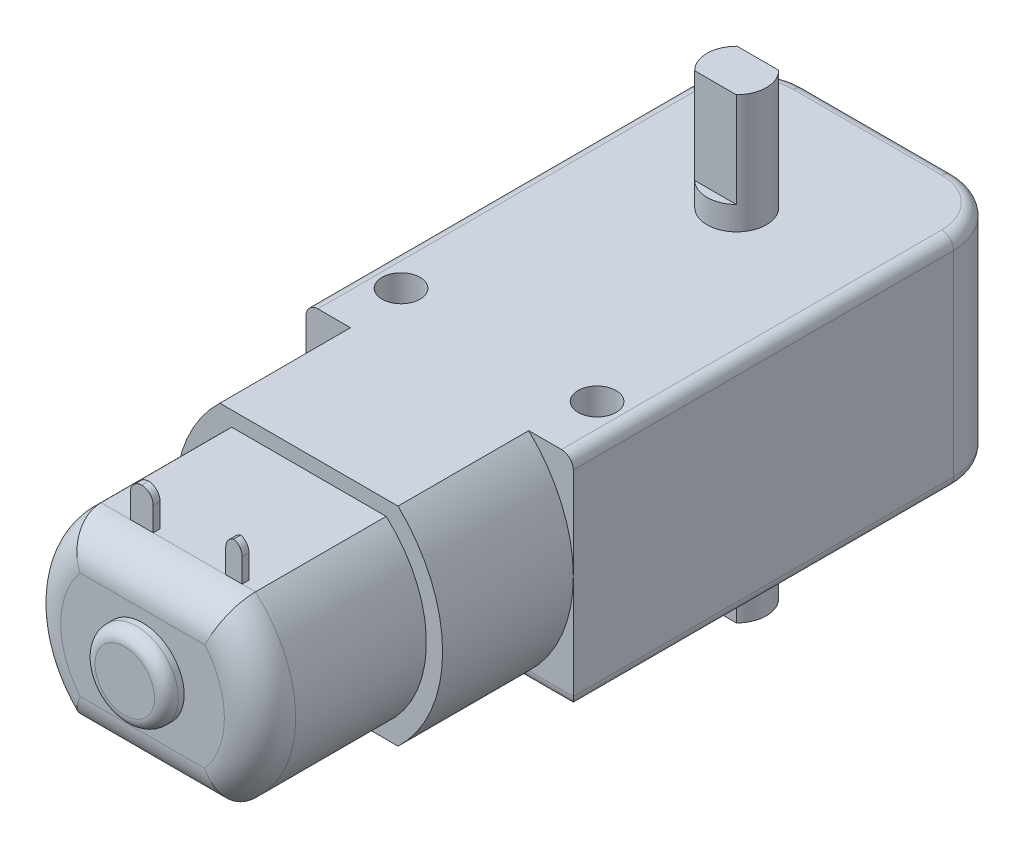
ISO-10303-21;
HEADER;
FILE_DESCRIPTION(('STEP AP214'),'2;1');
FILE_NAME('part.step','',(''),(''),'','','');
FILE_SCHEMA(('AUTOMOTIVE_DESIGN { 1 0 10303 214 1 1 1 1 }'));
ENDSEC;
DATA;
#1=APPLICATION_CONTEXT('core data for automotive mechanical design processes');
#2=APPLICATION_PROTOCOL_DEFINITION('international standard','automotive_design',2000,#1);
#3=PRODUCT_CONTEXT('',#1,'mechanical');
#4=PRODUCT('Part','Part','',(#3));
#5=PRODUCT_RELATED_PRODUCT_CATEGORY('part','',(#4));
#6=PRODUCT_DEFINITION_FORMATION('','',#4);
#7=PRODUCT_DEFINITION_CONTEXT('part definition',#1,'design');
#8=PRODUCT_DEFINITION('design','',#6,#7);
#9=PRODUCT_DEFINITION_SHAPE('','',#8);
#10=(LENGTH_UNIT() NAMED_UNIT(*) SI_UNIT(.MILLI.,.METRE.));
#11=(NAMED_UNIT(*) PLANE_ANGLE_UNIT() SI_UNIT($,.RADIAN.));
#12=(NAMED_UNIT(*) SI_UNIT($,.STERADIAN.) SOLID_ANGLE_UNIT());
#13=UNCERTAINTY_MEASURE_WITH_UNIT(LENGTH_MEASURE(1.E-05),#10,'distance_accuracy_value','');
#14=(GEOMETRIC_REPRESENTATION_CONTEXT(3) GLOBAL_UNCERTAINTY_ASSIGNED_CONTEXT((#13)) GLOBAL_UNIT_ASSIGNED_CONTEXT((#10,
#11,#12)) REPRESENTATION_CONTEXT('',''));
#15=CARTESIAN_POINT('',(0.,0.,0.));
#16=DIRECTION('',(0.,0.,1.));
#17=DIRECTION('',(1.,0.,0.));
#18=AXIS2_PLACEMENT_3D('',#15,#16,#17);
#19=CARTESIAN_POINT('',(-6.5,8.,62.));
#20=DIRECTION('',(0.,-1.,0.));
#21=DIRECTION('',(0.,0.,-1.));
#22=AXIS2_PLACEMENT_3D('',#19,#20,#21);
#23=PLANE('',#22);
#24=DIRECTION('',(0.,0.,-1.));
#25=VECTOR('',#24,1.);
#26=CARTESIAN_POINT('',(-2.10379390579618,8.,58.4234606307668));
#27=LINE('',#26,#25);
#28=CARTESIAN_POINT('',(-2.10379390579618,8.,59.));
#29=VERTEX_POINT('',#28);
#30=CARTESIAN_POINT('',(-2.10379390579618,8.,58.4234606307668));
#31=VERTEX_POINT('',#30);
#32=EDGE_CURVE('E339',#29,#31,#27,.T.);
#33=ORIENTED_EDGE('',*,*,#32,.F.);
#34=DIRECTION('',(-1.,0.,0.));
#35=VECTOR('',#34,1.);
#36=CARTESIAN_POINT('',(6.5,8.,59.));
#37=LINE('',#36,#35);
#38=CARTESIAN_POINT('',(3.99585452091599,8.,59.));
#39=VERTEX_POINT('',#38);
#40=EDGE_CURVE('E352',#29,#39,#37,.F.);
#41=ORIENTED_EDGE('',*,*,#40,.T.);
#42=DIRECTION('',(0.,0.,1.));
#43=VECTOR('',#42,1.);
#44=CARTESIAN_POINT('',(3.99585452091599,8.,58.4234606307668));
#45=LINE('',#44,#43);
#46=CARTESIAN_POINT('',(3.99585452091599,8.,58.4234606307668));
#47=VERTEX_POINT('',#46);
#48=EDGE_CURVE('E391',#47,#39,#45,.T.);
#49=ORIENTED_EDGE('',*,*,#48,.F.);
#50=DIRECTION('',(-1.,0.,0.));
#51=VECTOR('',#50,1.);
#52=CARTESIAN_POINT('',(5.37710690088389,8.,58.4234606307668));
#53=LINE('',#52,#51);
#54=CARTESIAN_POINT('',(5.37710690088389,8.,58.4234606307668));
#55=VERTEX_POINT('',#54);
#56=EDGE_CURVE('E388',#55,#47,#53,.T.);
#57=ORIENTED_EDGE('',*,*,#56,.F.);
#58=DIRECTION('',(0.,0.,-1.));
#59=VECTOR('',#58,1.);
#60=CARTESIAN_POINT('',(5.37710690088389,8.,58.4234606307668));
#61=LINE('',#60,#59);
#62=CARTESIAN_POINT('',(5.37710690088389,8.,59.));
#63=VERTEX_POINT('',#62);
#64=EDGE_CURVE('E385',#63,#55,#61,.T.);
#65=ORIENTED_EDGE('',*,*,#64,.F.);
#66=CARTESIAN_POINT('',(6.5,8.,59.));
#67=VERTEX_POINT('',#66);
#68=EDGE_CURVE('E364',#63,#67,#37,.F.);
#69=ORIENTED_EDGE('',*,*,#68,.T.);
#70=DIRECTION('',(0.,0.,-1.));
#71=VECTOR('',#70,1.);
#72=CARTESIAN_POINT('',(6.5,8.,62.));
#73=LINE('',#72,#71);
#74=CARTESIAN_POINT('',(6.5,8.,48.));
#75=VERTEX_POINT('',#74);
#76=EDGE_CURVE('E491',#67,#75,#73,.T.);
#77=ORIENTED_EDGE('',*,*,#76,.T.);
#78=DIRECTION('',(-1.,0.,0.));
#79=VECTOR('',#78,1.);
#80=CARTESIAN_POINT('',(-6.5,8.,48.));
#81=LINE('',#80,#79);
#82=CARTESIAN_POINT('',(-6.5,8.,48.));
#83=VERTEX_POINT('',#82);
#84=EDGE_CURVE('E486',#75,#83,#81,.T.);
#85=ORIENTED_EDGE('',*,*,#84,.T.);
#86=DIRECTION('',(0.,0.,-1.));
#87=VECTOR('',#86,1.);
#88=CARTESIAN_POINT('',(-6.5,8.,62.));
#89=LINE('',#88,#87);
#90=CARTESIAN_POINT('',(-6.5,8.,59.));
#91=VERTEX_POINT('',#90);
#92=EDGE_CURVE('E489',#91,#83,#89,.T.);
#93=ORIENTED_EDGE('',*,*,#92,.F.);
#94=CARTESIAN_POINT('',(-4.03250960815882,8.,59.));
#95=VERTEX_POINT('',#94);
#96=EDGE_CURVE('E363',#91,#95,#37,.F.);
#97=ORIENTED_EDGE('',*,*,#96,.T.);
#98=DIRECTION('',(0.,0.,1.));
#99=VECTOR('',#98,1.);
#100=CARTESIAN_POINT('',(-4.03250960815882,8.,58.4234606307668));
#101=LINE('',#100,#99);
#102=CARTESIAN_POINT('',(-4.03250960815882,8.,58.4234606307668));
#103=VERTEX_POINT('',#102);
#104=EDGE_CURVE('E374',#103,#95,#101,.T.);
#105=ORIENTED_EDGE('',*,*,#104,.F.);
#106=DIRECTION('',(-1.,0.,0.));
#107=VECTOR('',#106,1.);
#108=CARTESIAN_POINT('',(-2.10379390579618,8.,58.4234606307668));
#109=LINE('',#108,#107);
#110=EDGE_CURVE('E369',#31,#103,#109,.T.);
#111=ORIENTED_EDGE('',*,*,#110,.F.);
#112=EDGE_LOOP('',(#33,#41,#49,#57,#65,#69,#77,#85,#93,#97,#105,#111));
#113=FACE_BOUND('',#112,.T.);
#114=ADVANCED_FACE('F37',(#113),#23,.F.);
#115=CARTESIAN_POINT('',(0.,11.25,12.));
#116=DIRECTION('',(0.,1.,0.));
#117=DIRECTION('',(0.,0.,-1.));
#118=AXIS2_PLACEMENT_3D('',#115,#116,#117);
#119=PLANE('',#118);
#120=CARTESIAN_POINT('',(0.,11.25,12.));
#121=DIRECTION('',(0.,-1.,0.));
#122=DIRECTION('',(0.,0.,-1.));
#123=AXIS2_PLACEMENT_3D('',#120,#121,#122);
#124=CIRCLE('',#123,2.5);
#125=CARTESIAN_POINT('',(1.75,11.25,13.7853571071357));
#126=VERTEX_POINT('',#125);
#127=CARTESIAN_POINT('',(-1.75,11.25,13.7853571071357));
#128=VERTEX_POINT('',#127);
#129=EDGE_CURVE('E443',#126,#128,#124,.T.);
#130=ORIENTED_EDGE('',*,*,#129,.F.);
#131=DIRECTION('',(-1.,0.,0.));
#132=VECTOR('',#131,1.);
#133=CARTESIAN_POINT('',(1.75,11.25,13.7853571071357));
#134=LINE('',#133,#132);
#135=EDGE_CURVE('E417',#126,#128,#134,.T.);
#136=ORIENTED_EDGE('',*,*,#135,.T.);
#137=EDGE_LOOP('',(#130,#136));
#138=FACE_BOUND('',#137,.T.);
#139=ADVANCED_FACE('F762',(#138),#119,.T.);
#140=CARTESIAN_POINT('',(-1.75,11.25,10.2146428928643));
#141=VERTEX_POINT('',#140);
#142=CARTESIAN_POINT('',(1.75,11.25,10.2146428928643));
#143=VERTEX_POINT('',#142);
#144=EDGE_CURVE('E440',#141,#143,#124,.T.);
#145=ORIENTED_EDGE('',*,*,#144,.F.);
#146=DIRECTION('',(1.,0.,0.));
#147=VECTOR('',#146,1.);
#148=CARTESIAN_POINT('',(1.75,11.25,10.2146428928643));
#149=LINE('',#148,#147);
#150=EDGE_CURVE('E427',#141,#143,#149,.T.);
#151=ORIENTED_EDGE('',*,*,#150,.T.);
#152=EDGE_LOOP('',(#145,#151));
#153=FACE_BOUND('',#152,.T.);
#154=ADVANCED_FACE('F769',(#153),#119,.T.);
#155=CARTESIAN_POINT('',(0.,-11.25,12.));
#156=DIRECTION('',(0.,-1.,0.));
#157=DIRECTION('',(0.,0.,-1.));
#158=AXIS2_PLACEMENT_3D('',#155,#156,#157);
#159=PLANE('',#158);
#160=DIRECTION('',(1.,0.,0.));
#161=VECTOR('',#160,1.);
#162=CARTESIAN_POINT('',(1.75,-11.25,10.2146428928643));
#163=LINE('',#162,#161);
#164=CARTESIAN_POINT('',(-1.75,-11.25,10.2146428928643));
#165=VERTEX_POINT('',#164);
#166=CARTESIAN_POINT('',(1.75,-11.25,10.2146428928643));
#167=VERTEX_POINT('',#166);
#168=EDGE_CURVE('E450',#165,#167,#163,.T.);
#169=ORIENTED_EDGE('',*,*,#168,.F.);
#170=CARTESIAN_POINT('',(0.,-11.25,12.));
#171=DIRECTION('',(0.,-1.,0.));
#172=DIRECTION('',(0.,0.,-1.));
#173=AXIS2_PLACEMENT_3D('',#170,#171,#172);
#174=CIRCLE('',#173,2.5);
#175=EDGE_CURVE('E473',#165,#167,#174,.T.);
#176=ORIENTED_EDGE('',*,*,#175,.T.);
#177=EDGE_LOOP('',(#169,#176));
#178=FACE_BOUND('',#177,.T.);
#179=ADVANCED_FACE('F792',(#178),#159,.T.);
#180=CARTESIAN_POINT('',(0.833333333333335,0.499999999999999,48.));
#181=DIRECTION('',(0.,0.,-1.));
#182=DIRECTION('',(-1.,0.,0.));
#183=AXIS2_PLACEMENT_3D('',#180,#181,#182);
#184=PLANE('',#183);
#185=CARTESIAN_POINT('',(0.833333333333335,0.499999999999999,48.));
#186=DIRECTION('',(0.,0.,1.));
#187=DIRECTION('',(-1.,0.,0.));
#188=AXIS2_PLACEMENT_3D('',#185,#186,#187);
#189=CIRCLE('',#188,12.0833333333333);
#190=CARTESIAN_POINT('',(-7.5,9.25,48.));
#191=VERTEX_POINT('',#190);
#192=CARTESIAN_POINT('',(-7.5,-8.25,48.));
#193=VERTEX_POINT('',#192);
#194=EDGE_CURVE('E498',#191,#193,#189,.T.);
#195=ORIENTED_EDGE('',*,*,#194,.T.);
#196=DIRECTION('',(1.,0.,0.));
#197=VECTOR('',#196,1.);
#198=CARTESIAN_POINT('',(-7.5,-8.25,48.));
#199=LINE('',#198,#197);
#200=CARTESIAN_POINT('',(7.5,-8.25,48.));
#201=VERTEX_POINT('',#200);
#202=EDGE_CURVE('E501',#193,#201,#199,.T.);
#203=ORIENTED_EDGE('',*,*,#202,.T.);
#204=CARTESIAN_POINT('',(-0.833333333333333,0.499999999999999,48.));
#205=DIRECTION('',(0.,0.,1.));
#206=DIRECTION('',(1.,0.,0.));
#207=AXIS2_PLACEMENT_3D('',#204,#205,#206);
#208=CIRCLE('',#207,12.0833333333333);
#209=CARTESIAN_POINT('',(7.5,9.25,48.));
#210=VERTEX_POINT('',#209);
#211=EDGE_CURVE('E504',#201,#210,#208,.T.);
#212=ORIENTED_EDGE('',*,*,#211,.T.);
#213=DIRECTION('',(-1.,0.,0.));
#214=VECTOR('',#213,1.);
#215=CARTESIAN_POINT('',(-7.5,9.25,48.));
#216=LINE('',#215,#214);
#217=EDGE_CURVE('E506',#210,#191,#216,.T.);
#218=ORIENTED_EDGE('',*,*,#217,.T.);
#219=EDGE_LOOP('',(#195,#203,#212,#218));
#220=FACE_BOUND('',#219,.T.);
#221=CARTESIAN_POINT('',(0.114378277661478,0.499999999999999,48.));
#222=DIRECTION('',(0.,0.,1.));
#223=DIRECTION('',(1.,0.,0.));
#224=AXIS2_PLACEMENT_3D('',#221,#222,#223);
#225=CIRCLE('',#224,10.);
#226=CARTESIAN_POINT('',(-6.5,-7.,48.));
#227=VERTEX_POINT('',#226);
#228=EDGE_CURVE('E476',#83,#227,#225,.T.);
#229=ORIENTED_EDGE('',*,*,#228,.F.);
#230=ORIENTED_EDGE('',*,*,#84,.F.);
#231=CARTESIAN_POINT('',(-0.114378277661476,0.499999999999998,48.));
#232=DIRECTION('',(0.,0.,1.));
#233=DIRECTION('',(-1.,0.,0.));
#234=AXIS2_PLACEMENT_3D('',#231,#232,#233);
#235=CIRCLE('',#234,10.);
#236=CARTESIAN_POINT('',(6.5,-7.,48.));
#237=VERTEX_POINT('',#236);
#238=EDGE_CURVE('E483',#237,#75,#235,.T.);
#239=ORIENTED_EDGE('',*,*,#238,.F.);
#240=DIRECTION('',(1.,0.,0.));
#241=VECTOR('',#240,1.);
#242=CARTESIAN_POINT('',(-6.5,-7.,48.));
#243=LINE('',#242,#241);
#244=EDGE_CURVE('E479',#227,#237,#243,.T.);
#245=ORIENTED_EDGE('',*,*,#244,.F.);
#246=EDGE_LOOP('',(#229,#230,#239,#245));
#247=FACE_BOUND('',#246,.T.);
#248=ADVANCED_FACE('F788',(#220,#247),#184,.F.);
#249=CARTESIAN_POINT('',(0.,0.,37.));
#250=DIRECTION('',(0.,0.,1.));
#251=DIRECTION('',(1.,0.,0.));
#252=AXIS2_PLACEMENT_3D('',#249,#250,#251);
#253=PLANE('',#252);
#254=DIRECTION('',(1.,0.,0.));
#255=VECTOR('',#254,1.);
#256=CARTESIAN_POINT('',(11.25,-8.25,37.));
#257=LINE('',#256,#255);
#258=CARTESIAN_POINT('',(-11.25,-8.25,37.));
#259=VERTEX_POINT('',#258);
#260=CARTESIAN_POINT('',(-7.5,-8.25,37.));
#261=VERTEX_POINT('',#260);
#262=EDGE_CURVE('E584',#259,#261,#257,.T.);
#263=ORIENTED_EDGE('',*,*,#262,.T.);
#264=CARTESIAN_POINT('',(0.833333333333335,0.499999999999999,37.));
#265=DIRECTION('',(0.,0.,1.));
#266=DIRECTION('',(-1.,0.,0.));
#267=AXIS2_PLACEMENT_3D('',#264,#265,#266);
#268=CIRCLE('',#267,12.0833333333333);
#269=CARTESIAN_POINT('',(-11.25,0.499999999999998,37.));
#270=VERTEX_POINT('',#269);
#271=EDGE_CURVE('E497',#270,#261,#268,.T.);
#272=ORIENTED_EDGE('',*,*,#271,.F.);
#273=DIRECTION('',(0.,-1.,0.));
#274=VECTOR('',#273,1.);
#275=CARTESIAN_POINT('',(-11.25,9.25,37.));
#276=LINE('',#275,#274);
#277=EDGE_CURVE('E566',#270,#259,#276,.T.);
#278=ORIENTED_EDGE('',*,*,#277,.T.);
#279=EDGE_LOOP('',(#263,#272,#278));
#280=FACE_BOUND('',#279,.T.);
#281=ADVANCED_FACE('F791',(#280),#253,.T.);
#282=CARTESIAN_POINT('',(-11.25,8.25,37.));
#283=VERTEX_POINT('',#282);
#284=EDGE_CURVE('E562',#283,#270,#276,.T.);
#285=ORIENTED_EDGE('',*,*,#284,.T.);
#286=CARTESIAN_POINT('',(-7.5,9.25,37.));
#287=VERTEX_POINT('',#286);
#288=EDGE_CURVE('E509',#287,#270,#268,.T.);
#289=ORIENTED_EDGE('',*,*,#288,.F.);
#290=DIRECTION('',(-1.,0.,0.));
#291=VECTOR('',#290,1.);
#292=CARTESIAN_POINT('',(-11.25,9.25,37.));
#293=LINE('',#292,#291);
#294=CARTESIAN_POINT('',(-10.25,9.25,37.));
#295=VERTEX_POINT('',#294);
#296=EDGE_CURVE('E570',#287,#295,#293,.T.);
#297=ORIENTED_EDGE('',*,*,#296,.T.);
#298=CARTESIAN_POINT('',(-10.25,8.25,37.));
#299=DIRECTION('',(0.,0.,1.));
#300=DIRECTION('',(1.,0.,0.));
#301=AXIS2_PLACEMENT_3D('',#298,#299,#300);
#302=CIRCLE('',#301,1.);
#303=EDGE_CURVE('E646',#295,#283,#302,.T.);
#304=ORIENTED_EDGE('',*,*,#303,.T.);
#305=EDGE_LOOP('',(#285,#289,#297,#304));
#306=FACE_BOUND('',#305,.T.);
#307=ADVANCED_FACE('F834',(#306),#253,.T.);
#308=DIRECTION('',(0.,1.,0.));
#309=VECTOR('',#308,1.);
#310=CARTESIAN_POINT('',(11.25,9.25,37.));
#311=LINE('',#310,#309);
#312=CARTESIAN_POINT('',(11.25,-8.25,37.));
#313=VERTEX_POINT('',#312);
#314=CARTESIAN_POINT('',(11.25,0.499999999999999,37.));
#315=VERTEX_POINT('',#314);
#316=EDGE_CURVE('E567',#313,#315,#311,.T.);
#317=ORIENTED_EDGE('',*,*,#316,.T.);
#318=CARTESIAN_POINT('',(-0.833333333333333,0.499999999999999,37.));
#319=DIRECTION('',(0.,0.,1.));
#320=DIRECTION('',(1.,0.,0.));
#321=AXIS2_PLACEMENT_3D('',#318,#319,#320);
#322=CIRCLE('',#321,12.0833333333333);
#323=CARTESIAN_POINT('',(7.5,-8.25,37.));
#324=VERTEX_POINT('',#323);
#325=EDGE_CURVE('E502',#324,#315,#322,.T.);
#326=ORIENTED_EDGE('',*,*,#325,.F.);
#327=EDGE_CURVE('E583',#324,#313,#257,.T.);
#328=ORIENTED_EDGE('',*,*,#327,.T.);
#329=EDGE_LOOP('',(#317,#326,#328));
#330=FACE_BOUND('',#329,.T.);
#331=ADVANCED_FACE('F1290',(#330),#253,.T.);
#332=CARTESIAN_POINT('',(10.25,9.25,37.));
#333=VERTEX_POINT('',#332);
#334=CARTESIAN_POINT('',(7.5,9.25,37.));
#335=VERTEX_POINT('',#334);
#336=EDGE_CURVE('E571',#333,#335,#293,.T.);
#337=ORIENTED_EDGE('',*,*,#336,.T.);
#338=EDGE_CURVE('E515',#315,#335,#322,.T.);
#339=ORIENTED_EDGE('',*,*,#338,.F.);
#340=CARTESIAN_POINT('',(11.25,8.25,37.));
#341=VERTEX_POINT('',#340);
#342=EDGE_CURVE('E565',#315,#341,#311,.T.);
#343=ORIENTED_EDGE('',*,*,#342,.T.);
#344=CARTESIAN_POINT('',(10.25,8.25,37.));
#345=DIRECTION('',(0.,0.,1.));
#346=DIRECTION('',(1.,0.,0.));
#347=AXIS2_PLACEMENT_3D('',#344,#345,#346);
#348=CIRCLE('',#347,1.);
#349=EDGE_CURVE('E648',#341,#333,#348,.T.);
#350=ORIENTED_EDGE('',*,*,#349,.T.);
#351=EDGE_LOOP('',(#337,#339,#343,#350));
#352=FACE_BOUND('',#351,.T.);
#353=ADVANCED_FACE('F836',(#352),#253,.T.);
#354=CARTESIAN_POINT('',(0.,0.,0.));
#355=DIRECTION('',(0.,0.,1.));
#356=DIRECTION('',(1.,0.,0.));
#357=AXIS2_PLACEMENT_3D('',#354,#355,#356);
#358=PLANE('',#357);
#359=DIRECTION('',(0.,-1.,0.));
#360=VECTOR('',#359,1.);
#361=CARTESIAN_POINT('',(-6.25,0.,0.));
#362=LINE('',#361,#360);
#363=CARTESIAN_POINT('',(-6.25,-8.25,0.));
#364=VERTEX_POINT('',#363);
#365=CARTESIAN_POINT('',(-6.25,8.25,0.));
#366=VERTEX_POINT('',#365);
#367=EDGE_CURVE('E577',#364,#366,#362,.F.);
#368=ORIENTED_EDGE('',*,*,#367,.T.);
#369=DIRECTION('',(-1.,0.,0.));
#370=VECTOR('',#369,1.);
#371=CARTESIAN_POINT('',(0.,8.25,0.));
#372=LINE('',#371,#370);
#373=CARTESIAN_POINT('',(6.25,8.25,0.));
#374=VERTEX_POINT('',#373);
#375=EDGE_CURVE('E652',#366,#374,#372,.F.);
#376=ORIENTED_EDGE('',*,*,#375,.T.);
#377=DIRECTION('',(0.,1.,0.));
#378=VECTOR('',#377,1.);
#379=CARTESIAN_POINT('',(6.25,0.,0.));
#380=LINE('',#379,#378);
#381=CARTESIAN_POINT('',(6.25,-8.25,0.));
#382=VERTEX_POINT('',#381);
#383=EDGE_CURVE('E575',#374,#382,#380,.F.);
#384=ORIENTED_EDGE('',*,*,#383,.T.);
#385=DIRECTION('',(1.,0.,0.));
#386=VECTOR('',#385,1.);
#387=CARTESIAN_POINT('',(0.,-8.25,0.));
#388=LINE('',#387,#386);
#389=EDGE_CURVE('E605',#382,#364,#388,.F.);
#390=ORIENTED_EDGE('',*,*,#389,.T.);
#391=EDGE_LOOP('',(#368,#376,#384,#390));
#392=FACE_BOUND('',#391,.T.);
#393=DIRECTION('',(0.,1.,0.));
#394=VECTOR('',#393,1.);
#395=CARTESIAN_POINT('',(-2.5,1.5,0.));
#396=LINE('',#395,#394);
#397=CARTESIAN_POINT('',(-2.5,-1.5,0.));
#398=VERTEX_POINT('',#397);
#399=CARTESIAN_POINT('',(-2.5,1.5,0.));
#400=VERTEX_POINT('',#399);
#401=EDGE_CURVE('E535',#398,#400,#396,.T.);
#402=ORIENTED_EDGE('',*,*,#401,.F.);
#403=DIRECTION('',(-1.,0.,0.));
#404=VECTOR('',#403,1.);
#405=CARTESIAN_POINT('',(-2.5,-1.5,0.));
#406=LINE('',#405,#404);
#407=CARTESIAN_POINT('',(2.5,-1.5,0.));
#408=VERTEX_POINT('',#407);
#409=EDGE_CURVE('E540',#408,#398,#406,.T.);
#410=ORIENTED_EDGE('',*,*,#409,.F.);
#411=DIRECTION('',(0.,-1.,0.));
#412=VECTOR('',#411,1.);
#413=CARTESIAN_POINT('',(2.5,1.5,0.));
#414=LINE('',#413,#412);
#415=CARTESIAN_POINT('',(2.5,1.5,0.));
#416=VERTEX_POINT('',#415);
#417=EDGE_CURVE('E549',#416,#408,#414,.T.);
#418=ORIENTED_EDGE('',*,*,#417,.F.);
#419=DIRECTION('',(1.,0.,0.));
#420=VECTOR('',#419,1.);
#421=CARTESIAN_POINT('',(-2.5,1.5,0.));
#422=LINE('',#421,#420);
#423=EDGE_CURVE('E546',#400,#416,#422,.T.);
#424=ORIENTED_EDGE('',*,*,#423,.F.);
#425=EDGE_LOOP('',(#402,#410,#418,#424));
#426=FACE_BOUND('',#425,.T.);
#427=ADVANCED_FACE('F837',(#392,#426),#358,.F.);
#428=CARTESIAN_POINT('',(-11.25,9.25,37.));
#429=DIRECTION('',(1.,0.,0.));
#430=DIRECTION('',(0.,1.,0.));
#431=AXIS2_PLACEMENT_3D('',#428,#429,#430);
#432=PLANE('',#431);
#433=ORIENTED_EDGE('',*,*,#284,.F.);
#434=DIRECTION('',(0.,0.,-1.));
#435=VECTOR('',#434,1.);
#436=CARTESIAN_POINT('',(-11.25,8.25,37.));
#437=LINE('',#436,#435);
#438=CARTESIAN_POINT('',(-11.25,8.25,5.));
#439=VERTEX_POINT('',#438);
#440=EDGE_CURVE('E656',#283,#439,#437,.T.);
#441=ORIENTED_EDGE('',*,*,#440,.T.);
#442=DIRECTION('',(0.,-1.,0.));
#443=VECTOR('',#442,1.);
#444=CARTESIAN_POINT('',(-11.25,9.25,5.));
#445=LINE('',#444,#443);
#446=CARTESIAN_POINT('',(-11.25,-8.25,5.));
#447=VERTEX_POINT('',#446);
#448=EDGE_CURVE('E573',#439,#447,#445,.T.);
#449=ORIENTED_EDGE('',*,*,#448,.T.);
#450=DIRECTION('',(0.,0.,-1.));
#451=VECTOR('',#450,1.);
#452=CARTESIAN_POINT('',(-11.25,-8.25,37.));
#453=LINE('',#452,#451);
#454=EDGE_CURVE('E610',#447,#259,#453,.F.);
#455=ORIENTED_EDGE('',*,*,#454,.T.);
#456=ORIENTED_EDGE('',*,*,#277,.F.);
#457=EDGE_LOOP('',(#433,#441,#449,#455,#456));
#458=FACE_BOUND('',#457,.T.);
#459=ADVANCED_FACE('F840',(#458),#432,.F.);
#460=CARTESIAN_POINT('',(-11.25,-9.25,37.));
#461=DIRECTION('',(0.,1.,0.));
#462=DIRECTION('',(0.,0.,1.));
#463=AXIS2_PLACEMENT_3D('',#460,#461,#462);
#464=PLANE('',#463);
#465=CARTESIAN_POINT('',(8.25,-9.25,32.));
#466=DIRECTION('',(0.,1.,0.));
#467=DIRECTION('',(0.,0.,-1.));
#468=AXIS2_PLACEMENT_3D('',#465,#466,#467);
#469=CIRCLE('',#468,1.6);
#470=CARTESIAN_POINT('',(8.25,-9.25,30.4));
#471=VERTEX_POINT('',#470);
#472=EDGE_CURVE('E405',#471,#471,#469,.T.);
#473=ORIENTED_EDGE('',*,*,#472,.T.);
#474=EDGE_LOOP('',(#473));
#475=FACE_BOUND('',#474,.T.);
#476=CARTESIAN_POINT('',(-8.25,-9.25,32.));
#477=DIRECTION('',(0.,-1.,0.));
#478=DIRECTION('',(0.,0.,-1.));
#479=AXIS2_PLACEMENT_3D('',#476,#477,#478);
#480=CIRCLE('',#479,1.6);
#481=CARTESIAN_POINT('',(-8.25,-9.25,30.4));
#482=VERTEX_POINT('',#481);
#483=EDGE_CURVE('E409',#482,#482,#480,.T.);
#484=ORIENTED_EDGE('',*,*,#483,.F.);
#485=EDGE_LOOP('',(#484));
#486=FACE_BOUND('',#485,.T.);
#487=CARTESIAN_POINT('',(0.,-9.25,12.));
#488=DIRECTION('',(0.,1.,0.));
#489=DIRECTION('',(0.,0.,1.));
#490=AXIS2_PLACEMENT_3D('',#487,#488,#489);
#491=CIRCLE('',#490,2.5);
#492=CARTESIAN_POINT('',(0.,-9.25,14.5));
#493=VERTEX_POINT('',#492);
#494=EDGE_CURVE('E700',#493,#493,#491,.F.);
#495=ORIENTED_EDGE('',*,*,#494,.F.);
#496=EDGE_LOOP('',(#495));
#497=FACE_BOUND('',#496,.T.);
#498=DIRECTION('',(0.,0.,-1.));
#499=VECTOR('',#498,1.);
#500=CARTESIAN_POINT('',(10.25,-9.25,37.));
#501=LINE('',#500,#499);
#502=CARTESIAN_POINT('',(10.25,-9.25,5.));
#503=VERTEX_POINT('',#502);
#504=CARTESIAN_POINT('',(10.25,-9.25,36.));
#505=VERTEX_POINT('',#504);
#506=EDGE_CURVE('E595',#503,#505,#501,.F.);
#507=ORIENTED_EDGE('',*,*,#506,.T.);
#508=DIRECTION('',(1.,0.,0.));
#509=VECTOR('',#508,1.);
#510=CARTESIAN_POINT('',(-11.25,-9.25,36.));
#511=LINE('',#510,#509);
#512=CARTESIAN_POINT('',(-10.25,-9.25,36.));
#513=VERTEX_POINT('',#512);
#514=EDGE_CURVE('E597',#505,#513,#511,.F.);
#515=ORIENTED_EDGE('',*,*,#514,.T.);
#516=DIRECTION('',(0.,0.,-1.));
#517=VECTOR('',#516,1.);
#518=CARTESIAN_POINT('',(-10.25,-9.25,37.));
#519=LINE('',#518,#517);
#520=CARTESIAN_POINT('',(-10.25,-9.25,5.));
#521=VERTEX_POINT('',#520);
#522=EDGE_CURVE('E587',#513,#521,#519,.T.);
#523=ORIENTED_EDGE('',*,*,#522,.T.);
#524=CARTESIAN_POINT('',(-6.25,-9.25,5.));
#525=DIRECTION('',(0.,1.,0.));
#526=DIRECTION('',(0.,0.,1.));
#527=AXIS2_PLACEMENT_3D('',#524,#525,#526);
#528=CIRCLE('',#527,4.);
#529=CARTESIAN_POINT('',(-6.25,-9.25,0.999999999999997));
#530=VERTEX_POINT('',#529);
#531=EDGE_CURVE('E589',#521,#530,#528,.F.);
#532=ORIENTED_EDGE('',*,*,#531,.T.);
#533=DIRECTION('',(1.,0.,0.));
#534=VECTOR('',#533,1.);
#535=CARTESIAN_POINT('',(-11.25,-9.25,1.));
#536=LINE('',#535,#534);
#537=CARTESIAN_POINT('',(6.25,-9.25,1.));
#538=VERTEX_POINT('',#537);
#539=EDGE_CURVE('E591',#530,#538,#536,.T.);
#540=ORIENTED_EDGE('',*,*,#539,.T.);
#541=CARTESIAN_POINT('',(6.25,-9.25,5.));
#542=DIRECTION('',(0.,1.,0.));
#543=DIRECTION('',(0.,0.,1.));
#544=AXIS2_PLACEMENT_3D('',#541,#542,#543);
#545=CIRCLE('',#544,4.);
#546=EDGE_CURVE('E593',#538,#503,#545,.F.);
#547=ORIENTED_EDGE('',*,*,#546,.T.);
#548=EDGE_LOOP('',(#507,#515,#523,#532,#540,#547));
#549=FACE_BOUND('',#548,.T.);
#550=ADVANCED_FACE('F850',(#475,#486,#497,#549),#464,.F.);
#551=CARTESIAN_POINT('',(11.25,9.25,37.));
#552=DIRECTION('',(-1.,0.,0.));
#553=DIRECTION('',(0.,0.,1.));
#554=AXIS2_PLACEMENT_3D('',#551,#552,#553);
#555=PLANE('',#554);
#556=DIRECTION('',(0.,1.,0.));
#557=VECTOR('',#556,1.);
#558=CARTESIAN_POINT('',(11.25,9.25,5.));
#559=LINE('',#558,#557);
#560=CARTESIAN_POINT('',(11.25,-8.25,5.));
#561=VERTEX_POINT('',#560);
#562=CARTESIAN_POINT('',(11.25,8.25,5.));
#563=VERTEX_POINT('',#562);
#564=EDGE_CURVE('E580',#561,#563,#559,.T.);
#565=ORIENTED_EDGE('',*,*,#564,.T.);
#566=DIRECTION('',(0.,0.,-1.));
#567=VECTOR('',#566,1.);
#568=CARTESIAN_POINT('',(11.25,8.25,37.));
#569=LINE('',#568,#567);
#570=EDGE_CURVE('E643',#563,#341,#569,.F.);
#571=ORIENTED_EDGE('',*,*,#570,.T.);
#572=ORIENTED_EDGE('',*,*,#342,.F.);
#573=ORIENTED_EDGE('',*,*,#316,.F.);
#574=DIRECTION('',(0.,0.,-1.));
#575=VECTOR('',#574,1.);
#576=CARTESIAN_POINT('',(11.25,-8.25,37.));
#577=LINE('',#576,#575);
#578=EDGE_CURVE('E600',#313,#561,#577,.T.);
#579=ORIENTED_EDGE('',*,*,#578,.T.);
#580=EDGE_LOOP('',(#565,#571,#572,#573,#579));
#581=FACE_BOUND('',#580,.T.);
#582=ADVANCED_FACE('F846',(#581),#555,.F.);
#583=CARTESIAN_POINT('',(-11.25,9.25,37.));
#584=DIRECTION('',(0.,-1.,0.));
#585=DIRECTION('',(0.,0.,-1.));
#586=AXIS2_PLACEMENT_3D('',#583,#584,#585);
#587=PLANE('',#586);
#588=CARTESIAN_POINT('',(8.25,9.25,32.));
#589=DIRECTION('',(0.,-1.,0.));
#590=DIRECTION('',(0.,0.,-1.));
#591=AXIS2_PLACEMENT_3D('',#588,#589,#590);
#592=CIRCLE('',#591,1.6);
#593=CARTESIAN_POINT('',(8.25,9.25,30.4));
#594=VERTEX_POINT('',#593);
#595=EDGE_CURVE('E408',#594,#594,#592,.F.);
#596=ORIENTED_EDGE('',*,*,#595,.F.);
#597=EDGE_LOOP('',(#596));
#598=FACE_BOUND('',#597,.T.);
#599=CARTESIAN_POINT('',(-8.25,9.25,32.));
#600=DIRECTION('',(0.,-1.,0.));
#601=DIRECTION('',(0.,0.,-1.));
#602=AXIS2_PLACEMENT_3D('',#599,#600,#601);
#603=CIRCLE('',#602,1.6);
#604=CARTESIAN_POINT('',(-8.25,9.25,30.4));
#605=VERTEX_POINT('',#604);
#606=EDGE_CURVE('E412',#605,#605,#603,.T.);
#607=ORIENTED_EDGE('',*,*,#606,.T.);
#608=EDGE_LOOP('',(#607));
#609=FACE_BOUND('',#608,.T.);
#610=CARTESIAN_POINT('',(0.,9.25,12.));
#611=DIRECTION('',(0.,-1.,0.));
#612=DIRECTION('',(0.,0.,-1.));
#613=AXIS2_PLACEMENT_3D('',#610,#611,#612);
#614=CIRCLE('',#613,2.5);
#615=CARTESIAN_POINT('',(0.,9.25,9.5));
#616=VERTEX_POINT('',#615);
#617=EDGE_CURVE('E439',#616,#616,#614,.T.);
#618=ORIENTED_EDGE('',*,*,#617,.T.);
#619=EDGE_LOOP('',(#618));
#620=FACE_BOUND('',#619,.T.);
#621=ORIENTED_EDGE('',*,*,#336,.F.);
#622=DIRECTION('',(0.,0.,-1.));
#623=VECTOR('',#622,1.);
#624=CARTESIAN_POINT('',(10.25,9.25,37.));
#625=LINE('',#624,#623);
#626=CARTESIAN_POINT('',(10.25,9.25,5.));
#627=VERTEX_POINT('',#626);
#628=EDGE_CURVE('E640',#333,#627,#625,.T.);
#629=ORIENTED_EDGE('',*,*,#628,.T.);
#630=CARTESIAN_POINT('',(6.25,9.25,5.));
#631=DIRECTION('',(0.,-1.,0.));
#632=DIRECTION('',(0.,0.,-1.));
#633=AXIS2_PLACEMENT_3D('',#630,#631,#632);
#634=CIRCLE('',#633,4.);
#635=CARTESIAN_POINT('',(6.25,9.25,1.));
#636=VERTEX_POINT('',#635);
#637=EDGE_CURVE('E638',#627,#636,#634,.F.);
#638=ORIENTED_EDGE('',*,*,#637,.T.);
#639=DIRECTION('',(-1.,0.,0.));
#640=VECTOR('',#639,1.);
#641=CARTESIAN_POINT('',(-11.25,9.25,1.));
#642=LINE('',#641,#640);
#643=CARTESIAN_POINT('',(-6.25,9.25,0.999999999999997));
#644=VERTEX_POINT('',#643);
#645=EDGE_CURVE('E636',#636,#644,#642,.T.);
#646=ORIENTED_EDGE('',*,*,#645,.T.);
#647=CARTESIAN_POINT('',(-6.25,9.25,5.));
#648=DIRECTION('',(0.,-1.,0.));
#649=DIRECTION('',(0.,0.,-1.));
#650=AXIS2_PLACEMENT_3D('',#647,#648,#649);
#651=CIRCLE('',#650,4.);
#652=CARTESIAN_POINT('',(-10.25,9.25,5.));
#653=VERTEX_POINT('',#652);
#654=EDGE_CURVE('E634',#644,#653,#651,.F.);
#655=ORIENTED_EDGE('',*,*,#654,.T.);
#656=DIRECTION('',(0.,0.,-1.));
#657=VECTOR('',#656,1.);
#658=CARTESIAN_POINT('',(-10.25,9.25,37.));
#659=LINE('',#658,#657);
#660=EDGE_CURVE('E613',#653,#295,#659,.F.);
#661=ORIENTED_EDGE('',*,*,#660,.T.);
#662=ORIENTED_EDGE('',*,*,#296,.F.);
#663=DIRECTION('',(0.,0.,-1.));
#664=VECTOR('',#663,1.);
#665=CARTESIAN_POINT('',(-7.5,9.25,48.));
#666=LINE('',#665,#664);
#667=EDGE_CURVE('E508',#191,#287,#666,.T.);
#668=ORIENTED_EDGE('',*,*,#667,.F.);
#669=ORIENTED_EDGE('',*,*,#217,.F.);
#670=DIRECTION('',(0.,0.,-1.));
#671=VECTOR('',#670,1.);
#672=CARTESIAN_POINT('',(7.5,9.25,48.));
#673=LINE('',#672,#671);
#674=EDGE_CURVE('E520',#210,#335,#673,.T.);
#675=ORIENTED_EDGE('',*,*,#674,.T.);
#676=EDGE_LOOP('',(#621,#629,#638,#646,#655,#661,#662,#668,#669,#675));
#677=FACE_BOUND('',#676,.T.);
#678=ADVANCED_FACE('F842',(#598,#609,#620,#677),#587,.F.);
#679=CARTESIAN_POINT('',(-6.25,9.25,5.));
#680=DIRECTION('',(0.,-1.,0.));
#681=DIRECTION('',(1.,0.,0.));
#682=AXIS2_PLACEMENT_3D('',#679,#680,#681);
#683=CYLINDRICAL_SURFACE('',#682,5.);
#684=ORIENTED_EDGE('',*,*,#448,.F.);
#685=CARTESIAN_POINT('',(-6.25,8.25,5.));
#686=DIRECTION('',(0.,-1.,0.));
#687=DIRECTION('',(0.,0.,-1.));
#688=AXIS2_PLACEMENT_3D('',#685,#686,#687);
#689=CIRCLE('',#688,5.);
#690=EDGE_CURVE('E654',#439,#366,#689,.T.);
#691=ORIENTED_EDGE('',*,*,#690,.T.);
#692=ORIENTED_EDGE('',*,*,#367,.F.);
#693=CARTESIAN_POINT('',(-6.25,-8.25,5.));
#694=DIRECTION('',(0.,1.,0.));
#695=DIRECTION('',(0.,0.,1.));
#696=AXIS2_PLACEMENT_3D('',#693,#694,#695);
#697=CIRCLE('',#696,5.);
#698=EDGE_CURVE('E607',#364,#447,#697,.T.);
#699=ORIENTED_EDGE('',*,*,#698,.T.);
#700=EDGE_LOOP('',(#684,#691,#692,#699));
#701=FACE_BOUND('',#700,.T.);
#702=ADVANCED_FACE('F845',(#701),#683,.T.);
#703=CARTESIAN_POINT('',(6.25,9.25,5.));
#704=DIRECTION('',(0.,1.,0.));
#705=DIRECTION('',(0.,0.,1.));
#706=AXIS2_PLACEMENT_3D('',#703,#704,#705);
#707=CYLINDRICAL_SURFACE('',#706,5.);
#708=ORIENTED_EDGE('',*,*,#383,.F.);
#709=CARTESIAN_POINT('',(6.25,8.25,5.));
#710=DIRECTION('',(0.,-1.,0.));
#711=DIRECTION('',(0.,0.,-1.));
#712=AXIS2_PLACEMENT_3D('',#709,#710,#711);
#713=CIRCLE('',#712,5.);
#714=EDGE_CURVE('E650',#374,#563,#713,.T.);
#715=ORIENTED_EDGE('',*,*,#714,.T.);
#716=ORIENTED_EDGE('',*,*,#564,.F.);
#717=CARTESIAN_POINT('',(6.25,-8.25,5.));
#718=DIRECTION('',(0.,1.,0.));
#719=DIRECTION('',(0.,0.,1.));
#720=AXIS2_PLACEMENT_3D('',#717,#718,#719);
#721=CIRCLE('',#720,5.);
#722=EDGE_CURVE('E602',#561,#382,#721,.T.);
#723=ORIENTED_EDGE('',*,*,#722,.T.);
#724=EDGE_LOOP('',(#708,#715,#716,#723));
#725=FACE_BOUND('',#724,.T.);
#726=ADVANCED_FACE('F860',(#725),#707,.T.);
#727=CARTESIAN_POINT('',(-11.25,-8.25,1.));
#728=DIRECTION('',(1.,0.,0.));
#729=DIRECTION('',(0.,0.,-1.));
#730=AXIS2_PLACEMENT_3D('',#727,#728,#729);
#731=CYLINDRICAL_SURFACE('',#730,1.);
#732=CARTESIAN_POINT('',(6.25,-8.25,1.));
#733=DIRECTION('',(1.,0.,0.));
#734=DIRECTION('',(0.,0.,-1.));
#735=AXIS2_PLACEMENT_3D('',#732,#733,#734);
#736=CIRCLE('',#735,1.);
#737=EDGE_CURVE('E626',#538,#382,#736,.T.);
#738=ORIENTED_EDGE('',*,*,#737,.F.);
#739=ORIENTED_EDGE('',*,*,#539,.F.);
#740=CARTESIAN_POINT('',(-6.25,-8.25,1.));
#741=DIRECTION('',(-1.,0.,0.));
#742=DIRECTION('',(0.,0.,1.));
#743=AXIS2_PLACEMENT_3D('',#740,#741,#742);
#744=CIRCLE('',#743,1.);
#745=EDGE_CURVE('E629',#364,#530,#744,.T.);
#746=ORIENTED_EDGE('',*,*,#745,.F.);
#747=ORIENTED_EDGE('',*,*,#389,.F.);
#748=EDGE_LOOP('',(#738,#739,#746,#747));
#749=FACE_BOUND('',#748,.T.);
#750=ADVANCED_FACE('F864',(#749),#731,.T.);
#751=CARTESIAN_POINT('',(-6.25,-8.25,5.));
#752=DIRECTION('',(0.,1.,0.));
#753=DIRECTION('',(0.,0.,1.));
#754=AXIS2_PLACEMENT_3D('',#751,#752,#753);
#755=TOROIDAL_SURFACE('',#754,4.,1.);
#756=ORIENTED_EDGE('',*,*,#745,.T.);
#757=ORIENTED_EDGE('',*,*,#531,.F.);
#758=CARTESIAN_POINT('',(-10.25,-8.25,5.));
#759=DIRECTION('',(0.,0.,1.));
#760=DIRECTION('',(1.,0.,0.));
#761=AXIS2_PLACEMENT_3D('',#758,#759,#760);
#762=CIRCLE('',#761,1.);
#763=EDGE_CURVE('E623',#447,#521,#762,.T.);
#764=ORIENTED_EDGE('',*,*,#763,.F.);
#765=ORIENTED_EDGE('',*,*,#698,.F.);
#766=EDGE_LOOP('',(#756,#757,#764,#765));
#767=FACE_BOUND('',#766,.T.);
#768=ADVANCED_FACE('F882',(#767),#755,.T.);
#769=CARTESIAN_POINT('',(6.25,-8.25,5.));
#770=DIRECTION('',(0.,1.,0.));
#771=DIRECTION('',(0.,0.,1.));
#772=AXIS2_PLACEMENT_3D('',#769,#770,#771);
#773=TOROIDAL_SURFACE('',#772,4.,1.);
#774=ORIENTED_EDGE('',*,*,#737,.T.);
#775=ORIENTED_EDGE('',*,*,#722,.F.);
#776=CARTESIAN_POINT('',(10.25,-8.25,5.));
#777=DIRECTION('',(0.,0.,1.));
#778=DIRECTION('',(1.,0.,0.));
#779=AXIS2_PLACEMENT_3D('',#776,#777,#778);
#780=CIRCLE('',#779,1.);
#781=EDGE_CURVE('E620',#503,#561,#780,.T.);
#782=ORIENTED_EDGE('',*,*,#781,.F.);
#783=ORIENTED_EDGE('',*,*,#546,.F.);
#784=EDGE_LOOP('',(#774,#775,#782,#783));
#785=FACE_BOUND('',#784,.T.);
#786=ADVANCED_FACE('F878',(#785),#773,.T.);
#787=CARTESIAN_POINT('',(-10.25,-8.25,37.));
#788=DIRECTION('',(0.,0.,-1.));
#789=DIRECTION('',(-1.,0.,0.));
#790=AXIS2_PLACEMENT_3D('',#787,#788,#789);
#791=CYLINDRICAL_SURFACE('',#790,1.);
#792=ORIENTED_EDGE('',*,*,#763,.T.);
#793=ORIENTED_EDGE('',*,*,#522,.F.);
#794=CARTESIAN_POINT('',(-10.25,-8.25,36.));
#795=DIRECTION('',(-0.707106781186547,0.,-0.707106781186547));
#796=DIRECTION('',(0.707106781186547,0.,-0.707106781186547));
#797=AXIS2_PLACEMENT_3D('',#794,#795,#796);
#798=ELLIPSE('',#797,1.41421356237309,1.);
#799=EDGE_CURVE('E617',#259,#513,#798,.F.);
#800=ORIENTED_EDGE('',*,*,#799,.F.);
#801=ORIENTED_EDGE('',*,*,#454,.F.);
#802=EDGE_LOOP('',(#792,#793,#800,#801));
#803=FACE_BOUND('',#802,.T.);
#804=ADVANCED_FACE('F874',(#803),#791,.T.);
#805=CARTESIAN_POINT('',(10.25,-8.25,37.));
#806=DIRECTION('',(0.,0.,-1.));
#807=DIRECTION('',(-1.,0.,0.));
#808=AXIS2_PLACEMENT_3D('',#805,#806,#807);
#809=CYLINDRICAL_SURFACE('',#808,1.);
#810=ORIENTED_EDGE('',*,*,#781,.T.);
#811=ORIENTED_EDGE('',*,*,#578,.F.);
#812=CARTESIAN_POINT('',(10.25,-8.25,36.));
#813=DIRECTION('',(0.707106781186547,0.,-0.707106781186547));
#814=DIRECTION('',(-0.707106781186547,0.,-0.707106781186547));
#815=AXIS2_PLACEMENT_3D('',#812,#813,#814);
#816=ELLIPSE('',#815,1.41421356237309,1.);
#817=EDGE_CURVE('E614',#505,#313,#816,.F.);
#818=ORIENTED_EDGE('',*,*,#817,.F.);
#819=ORIENTED_EDGE('',*,*,#506,.F.);
#820=EDGE_LOOP('',(#810,#811,#818,#819));
#821=FACE_BOUND('',#820,.T.);
#822=ADVANCED_FACE('F870',(#821),#809,.T.);
#823=CARTESIAN_POINT('',(0.,-8.25,36.));
#824=DIRECTION('',(-1.,0.,0.));
#825=DIRECTION('',(0.,0.,1.));
#826=AXIS2_PLACEMENT_3D('',#823,#824,#825);
#827=CYLINDRICAL_SURFACE('',#826,1.);
#828=ORIENTED_EDGE('',*,*,#799,.T.);
#829=ORIENTED_EDGE('',*,*,#514,.F.);
#830=ORIENTED_EDGE('',*,*,#817,.T.);
#831=ORIENTED_EDGE('',*,*,#327,.F.);
#832=DIRECTION('',(1.,0.,0.));
#833=VECTOR('',#832,1.);
#834=CARTESIAN_POINT('',(-7.5,-8.25,37.));
#835=LINE('',#834,#833);
#836=EDGE_CURVE('E512',#261,#324,#835,.T.);
#837=ORIENTED_EDGE('',*,*,#836,.F.);
#838=ORIENTED_EDGE('',*,*,#262,.F.);
#839=EDGE_LOOP('',(#828,#829,#830,#831,#837,#838));
#840=FACE_BOUND('',#839,.T.);
#841=ADVANCED_FACE('F866',(#840),#827,.T.);
#842=CARTESIAN_POINT('',(-10.25,8.25,37.));
#843=DIRECTION('',(0.,0.,-1.));
#844=DIRECTION('',(-1.,0.,0.));
#845=AXIS2_PLACEMENT_3D('',#842,#843,#844);
#846=CYLINDRICAL_SURFACE('',#845,1.);
#847=ORIENTED_EDGE('',*,*,#303,.F.);
#848=ORIENTED_EDGE('',*,*,#660,.F.);
#849=CARTESIAN_POINT('',(-10.25,8.25,5.));
#850=DIRECTION('',(0.,0.,-1.));
#851=DIRECTION('',(-1.,0.,0.));
#852=AXIS2_PLACEMENT_3D('',#849,#850,#851);
#853=CIRCLE('',#852,1.);
#854=EDGE_CURVE('E618',#439,#653,#853,.T.);
#855=ORIENTED_EDGE('',*,*,#854,.F.);
#856=ORIENTED_EDGE('',*,*,#440,.F.);
#857=EDGE_LOOP('',(#847,#848,#855,#856));
#858=FACE_BOUND('',#857,.T.);
#859=ADVANCED_FACE('F869',(#858),#846,.T.);
#860=CARTESIAN_POINT('',(-6.25,8.25,5.));
#861=DIRECTION('',(0.,-1.,0.));
#862=DIRECTION('',(0.,0.,-1.));
#863=AXIS2_PLACEMENT_3D('',#860,#861,#862);
#864=TOROIDAL_SURFACE('',#863,4.,1.);
#865=ORIENTED_EDGE('',*,*,#854,.T.);
#866=ORIENTED_EDGE('',*,*,#654,.F.);
#867=CARTESIAN_POINT('',(-6.25,8.25,0.999999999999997));
#868=DIRECTION('',(1.,0.,0.));
#869=DIRECTION('',(0.,0.,-1.));
#870=AXIS2_PLACEMENT_3D('',#867,#868,#869);
#871=CIRCLE('',#870,1.);
#872=EDGE_CURVE('E663',#366,#644,#871,.T.);
#873=ORIENTED_EDGE('',*,*,#872,.F.);
#874=ORIENTED_EDGE('',*,*,#690,.F.);
#875=EDGE_LOOP('',(#865,#866,#873,#874));
#876=FACE_BOUND('',#875,.T.);
#877=ADVANCED_FACE('F900',(#876),#864,.T.);
#878=CARTESIAN_POINT('',(-11.25,8.25,1.));
#879=DIRECTION('',(-1.,0.,0.));
#880=DIRECTION('',(0.,0.,1.));
#881=AXIS2_PLACEMENT_3D('',#878,#879,#880);
#882=CYLINDRICAL_SURFACE('',#881,1.);
#883=ORIENTED_EDGE('',*,*,#872,.T.);
#884=ORIENTED_EDGE('',*,*,#645,.F.);
#885=CARTESIAN_POINT('',(6.25,8.25,1.));
#886=DIRECTION('',(1.,0.,0.));
#887=DIRECTION('',(0.,0.,-1.));
#888=AXIS2_PLACEMENT_3D('',#885,#886,#887);
#889=CIRCLE('',#888,1.);
#890=EDGE_CURVE('E660',#374,#636,#889,.T.);
#891=ORIENTED_EDGE('',*,*,#890,.F.);
#892=ORIENTED_EDGE('',*,*,#375,.F.);
#893=EDGE_LOOP('',(#883,#884,#891,#892));
#894=FACE_BOUND('',#893,.T.);
#895=ADVANCED_FACE('F896',(#894),#882,.T.);
#896=CARTESIAN_POINT('',(6.25,8.25,5.));
#897=DIRECTION('',(0.,-1.,0.));
#898=DIRECTION('',(0.,0.,-1.));
#899=AXIS2_PLACEMENT_3D('',#896,#897,#898);
#900=TOROIDAL_SURFACE('',#899,4.,1.);
#901=ORIENTED_EDGE('',*,*,#890,.T.);
#902=ORIENTED_EDGE('',*,*,#637,.F.);
#903=CARTESIAN_POINT('',(10.25,8.25,5.));
#904=DIRECTION('',(0.,0.,1.));
#905=DIRECTION('',(1.,0.,0.));
#906=AXIS2_PLACEMENT_3D('',#903,#904,#905);
#907=CIRCLE('',#906,1.);
#908=EDGE_CURVE('E561',#563,#627,#907,.T.);
#909=ORIENTED_EDGE('',*,*,#908,.F.);
#910=ORIENTED_EDGE('',*,*,#714,.F.);
#911=EDGE_LOOP('',(#901,#902,#909,#910));
#912=FACE_BOUND('',#911,.T.);
#913=ADVANCED_FACE('F892',(#912),#900,.T.);
#914=CARTESIAN_POINT('',(10.25,8.25,37.));
#915=DIRECTION('',(0.,0.,-1.));
#916=DIRECTION('',(-1.,0.,0.));
#917=AXIS2_PLACEMENT_3D('',#914,#915,#916);
#918=CYLINDRICAL_SURFACE('',#917,1.);
#919=ORIENTED_EDGE('',*,*,#349,.F.);
#920=ORIENTED_EDGE('',*,*,#570,.F.);
#921=ORIENTED_EDGE('',*,*,#908,.T.);
#922=ORIENTED_EDGE('',*,*,#628,.F.);
#923=EDGE_LOOP('',(#919,#920,#921,#922));
#924=FACE_BOUND('',#923,.T.);
#925=ADVANCED_FACE('F830',(#924),#918,.T.);
#926=CARTESIAN_POINT('',(-2.5,1.5,-5.));
#927=DIRECTION('',(1.,0.,0.));
#928=DIRECTION('',(0.,1.,0.));
#929=AXIS2_PLACEMENT_3D('',#926,#927,#928);
#930=PLANE('',#929);
#931=DIRECTION('',(0.,0.,1.));
#932=VECTOR('',#931,1.);
#933=CARTESIAN_POINT('',(-2.5,1.5,-5.));
#934=LINE('',#933,#932);
#935=CARTESIAN_POINT('',(-2.5,1.5,-4.));
#936=VERTEX_POINT('',#935);
#937=EDGE_CURVE('E559',#936,#400,#934,.T.);
#938=ORIENTED_EDGE('',*,*,#937,.F.);
#939=DIRECTION('',(0.,1.,0.));
#940=VECTOR('',#939,1.);
#941=CARTESIAN_POINT('',(-2.5,1.5,-4.));
#942=LINE('',#941,#940);
#943=CARTESIAN_POINT('',(-2.5,-1.5,-4.));
#944=VERTEX_POINT('',#943);
#945=EDGE_CURVE('E683',#936,#944,#942,.F.);
#946=ORIENTED_EDGE('',*,*,#945,.T.);
#947=DIRECTION('',(0.,0.,1.));
#948=VECTOR('',#947,1.);
#949=CARTESIAN_POINT('',(-2.5,-1.5,-5.));
#950=LINE('',#949,#948);
#951=EDGE_CURVE('E543',#944,#398,#950,.T.);
#952=ORIENTED_EDGE('',*,*,#951,.T.);
#953=ORIENTED_EDGE('',*,*,#401,.T.);
#954=EDGE_LOOP('',(#938,#946,#952,#953));
#955=FACE_BOUND('',#954,.T.);
#956=ADVANCED_FACE('F826',(#955),#930,.F.);
#957=CARTESIAN_POINT('',(-2.5,1.5,-5.));
#958=DIRECTION('',(0.,-1.,0.));
#959=DIRECTION('',(1.,0.,0.));
#960=AXIS2_PLACEMENT_3D('',#957,#958,#959);
#961=PLANE('',#960);
#962=CARTESIAN_POINT('',(0.,1.5,-2.5));
#963=DIRECTION('',(0.,-1.,0.));
#964=DIRECTION('',(1.,0.,0.));
#965=AXIS2_PLACEMENT_3D('',#962,#963,#964);
#966=CIRCLE('',#965,1.25);
#967=CARTESIAN_POINT('',(1.25,1.5,-2.5));
#968=VERTEX_POINT('',#967);
#969=EDGE_CURVE('E532',#968,#968,#966,.T.);
#970=ORIENTED_EDGE('',*,*,#969,.T.);
#971=EDGE_LOOP('',(#970));
#972=FACE_BOUND('',#971,.T.);
#973=DIRECTION('',(0.,0.,1.));
#974=VECTOR('',#973,1.);
#975=CARTESIAN_POINT('',(2.5,1.5,-5.));
#976=LINE('',#975,#974);
#977=CARTESIAN_POINT('',(2.5,1.5,-4.));
#978=VERTEX_POINT('',#977);
#979=EDGE_CURVE('E557',#978,#416,#976,.T.);
#980=ORIENTED_EDGE('',*,*,#979,.F.);
#981=CARTESIAN_POINT('',(1.5,1.5,-4.));
#982=DIRECTION('',(0.,-1.,0.));
#983=DIRECTION('',(1.,0.,0.));
#984=AXIS2_PLACEMENT_3D('',#981,#982,#983);
#985=CIRCLE('',#984,1.);
#986=CARTESIAN_POINT('',(1.5,1.5,-5.));
#987=VERTEX_POINT('',#986);
#988=EDGE_CURVE('E681',#978,#987,#985,.F.);
#989=ORIENTED_EDGE('',*,*,#988,.T.);
#990=DIRECTION('',(1.,0.,0.));
#991=VECTOR('',#990,1.);
#992=CARTESIAN_POINT('',(-2.5,1.5,-5.));
#993=LINE('',#992,#991);
#994=CARTESIAN_POINT('',(-1.5,1.5,-5.));
#995=VERTEX_POINT('',#994);
#996=EDGE_CURVE('E536',#995,#987,#993,.T.);
#997=ORIENTED_EDGE('',*,*,#996,.F.);
#998=CARTESIAN_POINT('',(-1.5,1.5,-4.));
#999=DIRECTION('',(0.,-1.,0.));
#1000=DIRECTION('',(1.,0.,0.));
#1001=AXIS2_PLACEMENT_3D('',#998,#999,#1000);
#1002=CIRCLE('',#1001,1.);
#1003=EDGE_CURVE('E679',#995,#936,#1002,.F.);
#1004=ORIENTED_EDGE('',*,*,#1003,.T.);
#1005=ORIENTED_EDGE('',*,*,#937,.T.);
#1006=ORIENTED_EDGE('',*,*,#423,.T.);
#1007=EDGE_LOOP('',(#980,#989,#997,#1004,#1005,#1006));
#1008=FACE_BOUND('',#1007,.T.);
#1009=ADVANCED_FACE('F822',(#972,#1008),#961,.F.);
#1010=CARTESIAN_POINT('',(2.5,1.5,-5.));
#1011=DIRECTION('',(-1.,0.,0.));
#1012=DIRECTION('',(0.,-1.,0.));
#1013=AXIS2_PLACEMENT_3D('',#1010,#1011,#1012);
#1014=PLANE('',#1013);
#1015=DIRECTION('',(0.,0.,1.));
#1016=VECTOR('',#1015,1.);
#1017=CARTESIAN_POINT('',(2.5,-1.5,-5.));
#1018=LINE('',#1017,#1016);
#1019=CARTESIAN_POINT('',(2.5,-1.5,-4.));
#1020=VERTEX_POINT('',#1019);
#1021=EDGE_CURVE('E555',#1020,#408,#1018,.T.);
#1022=ORIENTED_EDGE('',*,*,#1021,.F.);
#1023=DIRECTION('',(0.,-1.,0.));
#1024=VECTOR('',#1023,1.);
#1025=CARTESIAN_POINT('',(2.5,1.5,-4.));
#1026=LINE('',#1025,#1024);
#1027=EDGE_CURVE('E677',#1020,#978,#1026,.F.);
#1028=ORIENTED_EDGE('',*,*,#1027,.T.);
#1029=ORIENTED_EDGE('',*,*,#979,.T.);
#1030=ORIENTED_EDGE('',*,*,#417,.T.);
#1031=EDGE_LOOP('',(#1022,#1028,#1029,#1030));
#1032=FACE_BOUND('',#1031,.T.);
#1033=ADVANCED_FACE('F818',(#1032),#1014,.F.);
#1034=CARTESIAN_POINT('',(-2.5,-1.5,-5.));
#1035=DIRECTION('',(0.,1.,0.));
#1036=DIRECTION('',(-1.,0.,0.));
#1037=AXIS2_PLACEMENT_3D('',#1034,#1035,#1036);
#1038=PLANE('',#1037);
#1039=CARTESIAN_POINT('',(0.,-1.5,-2.5));
#1040=DIRECTION('',(0.,-1.,0.));
#1041=DIRECTION('',(1.,0.,0.));
#1042=AXIS2_PLACEMENT_3D('',#1039,#1040,#1041);
#1043=CIRCLE('',#1042,1.25);
#1044=CARTESIAN_POINT('',(1.25,-1.5,-2.5));
#1045=VERTEX_POINT('',#1044);
#1046=EDGE_CURVE('E529',#1045,#1045,#1043,.T.);
#1047=ORIENTED_EDGE('',*,*,#1046,.F.);
#1048=EDGE_LOOP('',(#1047));
#1049=FACE_BOUND('',#1048,.T.);
#1050=DIRECTION('',(-1.,0.,0.));
#1051=VECTOR('',#1050,1.);
#1052=CARTESIAN_POINT('',(-2.5,-1.5,-5.));
#1053=LINE('',#1052,#1051);
#1054=CARTESIAN_POINT('',(1.5,-1.5,-5.));
#1055=VERTEX_POINT('',#1054);
#1056=CARTESIAN_POINT('',(-1.5,-1.5,-5.));
#1057=VERTEX_POINT('',#1056);
#1058=EDGE_CURVE('E539',#1055,#1057,#1053,.T.);
#1059=ORIENTED_EDGE('',*,*,#1058,.F.);
#1060=CARTESIAN_POINT('',(1.5,-1.5,-4.));
#1061=DIRECTION('',(0.,1.,0.));
#1062=DIRECTION('',(-1.,0.,0.));
#1063=AXIS2_PLACEMENT_3D('',#1060,#1061,#1062);
#1064=CIRCLE('',#1063,1.);
#1065=EDGE_CURVE('E675',#1055,#1020,#1064,.F.);
#1066=ORIENTED_EDGE('',*,*,#1065,.T.);
#1067=ORIENTED_EDGE('',*,*,#1021,.T.);
#1068=ORIENTED_EDGE('',*,*,#409,.T.);
#1069=ORIENTED_EDGE('',*,*,#951,.F.);
#1070=CARTESIAN_POINT('',(-1.5,-1.5,-4.));
#1071=DIRECTION('',(0.,1.,0.));
#1072=DIRECTION('',(-1.,0.,0.));
#1073=AXIS2_PLACEMENT_3D('',#1070,#1071,#1072);
#1074=CIRCLE('',#1073,1.);
#1075=EDGE_CURVE('E673',#944,#1057,#1074,.F.);
#1076=ORIENTED_EDGE('',*,*,#1075,.T.);
#1077=EDGE_LOOP('',(#1059,#1066,#1067,#1068,#1069,#1076));
#1078=FACE_BOUND('',#1077,.T.);
#1079=ADVANCED_FACE('F814',(#1049,#1078),#1038,.F.);
#1080=CARTESIAN_POINT('',(0.,0.,-5.));
#1081=DIRECTION('',(0.,0.,1.));
#1082=DIRECTION('',(1.,0.,0.));
#1083=AXIS2_PLACEMENT_3D('',#1080,#1081,#1082);
#1084=PLANE('',#1083);
#1085=ORIENTED_EDGE('',*,*,#996,.T.);
#1086=DIRECTION('',(0.,-1.,0.));
#1087=VECTOR('',#1086,1.);
#1088=CARTESIAN_POINT('',(1.5,0.,-5.));
#1089=LINE('',#1088,#1087);
#1090=EDGE_CURVE('E670',#987,#1055,#1089,.T.);
#1091=ORIENTED_EDGE('',*,*,#1090,.T.);
#1092=ORIENTED_EDGE('',*,*,#1058,.T.);
#1093=DIRECTION('',(0.,1.,0.));
#1094=VECTOR('',#1093,1.);
#1095=CARTESIAN_POINT('',(-1.5,0.,-5.));
#1096=LINE('',#1095,#1094);
#1097=EDGE_CURVE('E658',#1057,#995,#1096,.T.);
#1098=ORIENTED_EDGE('',*,*,#1097,.T.);
#1099=EDGE_LOOP('',(#1085,#1091,#1092,#1098));
#1100=FACE_BOUND('',#1099,.T.);
#1101=ADVANCED_FACE('F810',(#1100),#1084,.F.);
#1102=CARTESIAN_POINT('',(1.5,0.,-4.));
#1103=DIRECTION('',(0.,-1.,0.));
#1104=DIRECTION('',(1.,0.,0.));
#1105=AXIS2_PLACEMENT_3D('',#1102,#1103,#1104);
#1106=CYLINDRICAL_SURFACE('',#1105,1.);
#1107=ORIENTED_EDGE('',*,*,#988,.F.);
#1108=ORIENTED_EDGE('',*,*,#1027,.F.);
#1109=ORIENTED_EDGE('',*,*,#1065,.F.);
#1110=ORIENTED_EDGE('',*,*,#1090,.F.);
#1111=EDGE_LOOP('',(#1107,#1108,#1109,#1110));
#1112=FACE_BOUND('',#1111,.T.);
#1113=ADVANCED_FACE('F813',(#1112),#1106,.T.);
#1114=CARTESIAN_POINT('',(-1.5,0.,-4.));
#1115=DIRECTION('',(0.,1.,0.));
#1116=DIRECTION('',(-1.,0.,0.));
#1117=AXIS2_PLACEMENT_3D('',#1114,#1115,#1116);
#1118=CYLINDRICAL_SURFACE('',#1117,1.);
#1119=ORIENTED_EDGE('',*,*,#1075,.F.);
#1120=ORIENTED_EDGE('',*,*,#945,.F.);
#1121=ORIENTED_EDGE('',*,*,#1003,.F.);
#1122=ORIENTED_EDGE('',*,*,#1097,.F.);
#1123=EDGE_LOOP('',(#1119,#1120,#1121,#1122));
#1124=FACE_BOUND('',#1123,.T.);
#1125=ADVANCED_FACE('F808',(#1124),#1118,.T.);
#1126=CARTESIAN_POINT('',(0.,3.5,-2.5));
#1127=DIRECTION('',(0.,-1.,0.));
#1128=DIRECTION('',(1.,0.,0.));
#1129=AXIS2_PLACEMENT_3D('',#1126,#1127,#1128);
#1130=CYLINDRICAL_SURFACE('',#1129,1.25);
#1131=ORIENTED_EDGE('',*,*,#1046,.T.);
#1132=EDGE_LOOP('',(#1131));
#1133=FACE_BOUND('',#1132,.T.);
#1134=ORIENTED_EDGE('',*,*,#969,.F.);
#1135=EDGE_LOOP('',(#1134));
#1136=FACE_BOUND('',#1135,.T.);
#1137=ADVANCED_FACE('F804',(#1133,#1136),#1130,.F.);
#1138=CARTESIAN_POINT('',(0.833333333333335,0.499999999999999,48.));
#1139=DIRECTION('',(0.,0.,-1.));
#1140=DIRECTION('',(-1.,0.,0.));
#1141=AXIS2_PLACEMENT_3D('',#1138,#1139,#1140);
#1142=CYLINDRICAL_SURFACE('',#1141,12.0833333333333);
#1143=ORIENTED_EDGE('',*,*,#288,.T.);
#1144=ORIENTED_EDGE('',*,*,#271,.T.);
#1145=DIRECTION('',(0.,0.,-1.));
#1146=VECTOR('',#1145,1.);
#1147=CARTESIAN_POINT('',(-7.5,-8.25,48.));
#1148=LINE('',#1147,#1146);
#1149=EDGE_CURVE('E526',#193,#261,#1148,.T.);
#1150=ORIENTED_EDGE('',*,*,#1149,.F.);
#1151=ORIENTED_EDGE('',*,*,#194,.F.);
#1152=ORIENTED_EDGE('',*,*,#667,.T.);
#1153=EDGE_LOOP('',(#1143,#1144,#1150,#1151,#1152));
#1154=FACE_BOUND('',#1153,.T.);
#1155=ADVANCED_FACE('F800',(#1154),#1142,.T.);
#1156=CARTESIAN_POINT('',(-7.5,-8.25,48.));
#1157=DIRECTION('',(0.,1.,0.));
#1158=DIRECTION('',(0.,0.,1.));
#1159=AXIS2_PLACEMENT_3D('',#1156,#1157,#1158);
#1160=PLANE('',#1159);
#1161=ORIENTED_EDGE('',*,*,#836,.T.);
#1162=DIRECTION('',(0.,0.,-1.));
#1163=VECTOR('',#1162,1.);
#1164=CARTESIAN_POINT('',(7.5,-8.25,48.));
#1165=LINE('',#1164,#1163);
#1166=EDGE_CURVE('E523',#201,#324,#1165,.T.);
#1167=ORIENTED_EDGE('',*,*,#1166,.F.);
#1168=ORIENTED_EDGE('',*,*,#202,.F.);
#1169=ORIENTED_EDGE('',*,*,#1149,.T.);
#1170=EDGE_LOOP('',(#1161,#1167,#1168,#1169));
#1171=FACE_BOUND('',#1170,.T.);
#1172=ADVANCED_FACE('F796',(#1171),#1160,.F.);
#1173=CARTESIAN_POINT('',(-0.833333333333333,0.499999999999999,48.));
#1174=DIRECTION('',(0.,0.,-1.));
#1175=DIRECTION('',(-1.,0.,0.));
#1176=AXIS2_PLACEMENT_3D('',#1173,#1174,#1175);
#1177=CYLINDRICAL_SURFACE('',#1176,12.0833333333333);
#1178=ORIENTED_EDGE('',*,*,#325,.T.);
#1179=ORIENTED_EDGE('',*,*,#338,.T.);
#1180=ORIENTED_EDGE('',*,*,#674,.F.);
#1181=ORIENTED_EDGE('',*,*,#211,.F.);
#1182=ORIENTED_EDGE('',*,*,#1166,.T.);
#1183=EDGE_LOOP('',(#1178,#1179,#1180,#1181,#1182));
#1184=FACE_BOUND('',#1183,.T.);
#1185=ADVANCED_FACE('F786',(#1184),#1177,.T.);
#1186=CARTESIAN_POINT('',(0.114378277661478,0.499999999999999,62.));
#1187=DIRECTION('',(0.,0.,-1.));
#1188=DIRECTION('',(-1.,0.,0.));
#1189=AXIS2_PLACEMENT_3D('',#1186,#1187,#1188);
#1190=CYLINDRICAL_SURFACE('',#1189,10.);
#1191=DIRECTION('',(0.,0.,-1.));
#1192=VECTOR('',#1191,1.);
#1193=CARTESIAN_POINT('',(-6.5,-7.,62.));
#1194=LINE('',#1193,#1192);
#1195=CARTESIAN_POINT('',(-6.5,-7.,59.));
#1196=VERTEX_POINT('',#1195);
#1197=EDGE_CURVE('E495',#1196,#227,#1194,.T.);
#1198=ORIENTED_EDGE('',*,*,#1197,.F.);
#1199=CARTESIAN_POINT('',(0.114378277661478,0.499999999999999,59.));
#1200=DIRECTION('',(0.,0.,1.));
#1201=DIRECTION('',(1.,0.,0.));
#1202=AXIS2_PLACEMENT_3D('',#1199,#1200,#1201);
#1203=CIRCLE('',#1202,10.);
#1204=EDGE_CURVE('E698',#1196,#91,#1203,.F.);
#1205=ORIENTED_EDGE('',*,*,#1204,.T.);
#1206=ORIENTED_EDGE('',*,*,#92,.T.);
#1207=ORIENTED_EDGE('',*,*,#228,.T.);
#1208=EDGE_LOOP('',(#1198,#1205,#1206,#1207));
#1209=FACE_BOUND('',#1208,.T.);
#1210=ADVANCED_FACE('F782',(#1209),#1190,.T.);
#1211=CARTESIAN_POINT('',(-6.5,-7.,62.));
#1212=DIRECTION('',(0.,1.,0.));
#1213=DIRECTION('',(0.,0.,1.));
#1214=AXIS2_PLACEMENT_3D('',#1211,#1212,#1213);
#1215=PLANE('',#1214);
#1216=DIRECTION('',(0.,0.,-1.));
#1217=VECTOR('',#1216,1.);
#1218=CARTESIAN_POINT('',(6.5,-7.,62.));
#1219=LINE('',#1218,#1217);
#1220=CARTESIAN_POINT('',(6.5,-7.,59.));
#1221=VERTEX_POINT('',#1220);
#1222=EDGE_CURVE('E493',#1221,#237,#1219,.T.);
#1223=ORIENTED_EDGE('',*,*,#1222,.F.);
#1224=DIRECTION('',(1.,0.,0.));
#1225=VECTOR('',#1224,1.);
#1226=CARTESIAN_POINT('',(-6.5,-7.,59.));
#1227=LINE('',#1226,#1225);
#1228=EDGE_CURVE('E696',#1221,#1196,#1227,.F.);
#1229=ORIENTED_EDGE('',*,*,#1228,.T.);
#1230=ORIENTED_EDGE('',*,*,#1197,.T.);
#1231=ORIENTED_EDGE('',*,*,#244,.T.);
#1232=EDGE_LOOP('',(#1223,#1229,#1230,#1231));
#1233=FACE_BOUND('',#1232,.T.);
#1234=ADVANCED_FACE('F778',(#1233),#1215,.F.);
#1235=CARTESIAN_POINT('',(-0.114378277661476,0.499999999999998,62.));
#1236=DIRECTION('',(0.,0.,-1.));
#1237=DIRECTION('',(-1.,0.,0.));
#1238=AXIS2_PLACEMENT_3D('',#1235,#1236,#1237);
#1239=CYLINDRICAL_SURFACE('',#1238,10.);
#1240=ORIENTED_EDGE('',*,*,#76,.F.);
#1241=CARTESIAN_POINT('',(-0.114378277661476,0.499999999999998,59.));
#1242=DIRECTION('',(0.,0.,1.));
#1243=DIRECTION('',(1.,0.,0.));
#1244=AXIS2_PLACEMENT_3D('',#1241,#1242,#1243);
#1245=CIRCLE('',#1244,10.);
#1246=EDGE_CURVE('E694',#67,#1221,#1245,.F.);
#1247=ORIENTED_EDGE('',*,*,#1246,.T.);
#1248=ORIENTED_EDGE('',*,*,#1222,.T.);
#1249=ORIENTED_EDGE('',*,*,#238,.T.);
#1250=EDGE_LOOP('',(#1240,#1247,#1248,#1249));
#1251=FACE_BOUND('',#1250,.T.);
#1252=ADVANCED_FACE('F775',(#1251),#1239,.T.);
#1253=CARTESIAN_POINT('',(0.114378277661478,0.499999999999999,62.));
#1254=DIRECTION('',(0.,0.,1.));
#1255=DIRECTION('',(1.,0.,0.));
#1256=AXIS2_PLACEMENT_3D('',#1253,#1254,#1255);
#1257=PLANE('',#1256);
#1258=CARTESIAN_POINT('',(0.,0.499999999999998,62.));
#1259=DIRECTION('',(0.,0.,1.));
#1260=DIRECTION('',(1.,0.,0.));
#1261=AXIS2_PLACEMENT_3D('',#1258,#1259,#1260);
#1262=CIRCLE('',#1261,3.5);
#1263=CARTESIAN_POINT('',(3.5,0.499999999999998,62.));
#1264=VERTEX_POINT('',#1263);
#1265=EDGE_CURVE('E402',#1264,#1264,#1262,.T.);
#1266=ORIENTED_EDGE('',*,*,#1265,.F.);
#1267=EDGE_LOOP('',(#1266));
#1268=FACE_BOUND('',#1267,.T.);
#1269=CARTESIAN_POINT('',(-0.114378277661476,0.499999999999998,62.));
#1270=DIRECTION('',(0.,0.,1.));
#1271=DIRECTION('',(1.,0.,0.));
#1272=AXIS2_PLACEMENT_3D('',#1269,#1270,#1271);
#1273=CIRCLE('',#1272,7.);
#1274=CARTESIAN_POINT('',(5.24752436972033,-4.,62.));
#1275=VERTEX_POINT('',#1274);
#1276=CARTESIAN_POINT('',(5.24752436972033,5.,62.));
#1277=VERTEX_POINT('',#1276);
#1278=EDGE_CURVE('E689',#1275,#1277,#1273,.T.);
#1279=ORIENTED_EDGE('',*,*,#1278,.T.);
#1280=DIRECTION('',(-1.,0.,0.));
#1281=VECTOR('',#1280,1.);
#1282=CARTESIAN_POINT('',(-6.5,5.,62.));
#1283=LINE('',#1282,#1281);
#1284=CARTESIAN_POINT('',(-5.24752436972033,5.,62.));
#1285=VERTEX_POINT('',#1284);
#1286=EDGE_CURVE('E691',#1277,#1285,#1283,.T.);
#1287=ORIENTED_EDGE('',*,*,#1286,.T.);
#1288=CARTESIAN_POINT('',(0.114378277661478,0.499999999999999,62.));
#1289=DIRECTION('',(0.,0.,1.));
#1290=DIRECTION('',(1.,0.,0.));
#1291=AXIS2_PLACEMENT_3D('',#1288,#1289,#1290);
#1292=CIRCLE('',#1291,7.);
#1293=CARTESIAN_POINT('',(-5.24752436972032,-4.,62.));
#1294=VERTEX_POINT('',#1293);
#1295=EDGE_CURVE('E685',#1285,#1294,#1292,.T.);
#1296=ORIENTED_EDGE('',*,*,#1295,.T.);
#1297=DIRECTION('',(1.,0.,0.));
#1298=VECTOR('',#1297,1.);
#1299=CARTESIAN_POINT('',(6.5,-4.,62.));
#1300=LINE('',#1299,#1298);
#1301=EDGE_CURVE('E687',#1294,#1275,#1300,.T.);
#1302=ORIENTED_EDGE('',*,*,#1301,.T.);
#1303=EDGE_LOOP('',(#1279,#1287,#1296,#1302));
#1304=FACE_BOUND('',#1303,.T.);
#1305=ADVANCED_FACE('F738',(#1268,#1304),#1257,.T.);
#1306=CARTESIAN_POINT('',(0.114378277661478,-4.,59.));
#1307=DIRECTION('',(-1.,0.,0.));
#1308=DIRECTION('',(0.,0.,1.));
#1309=AXIS2_PLACEMENT_3D('',#1306,#1307,#1308);
#1310=CYLINDRICAL_SURFACE('',#1309,3.);
#1311=CARTESIAN_POINT('',(-6.5,-7.,59.));
#1312=CARTESIAN_POINT('',(-6.5000026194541,-7.00001065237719,59.0802587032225));
#1313=CARTESIAN_POINT('',(-6.49878271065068,-6.99677945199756,59.1605121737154));
#1314=CARTESIAN_POINT('',(-6.49391847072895,-6.9839150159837,59.3204178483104));
#1315=CARTESIAN_POINT('',(-6.49027452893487,-6.9742828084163,59.4000701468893));
#1316=CARTESIAN_POINT('',(-6.48059386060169,-6.94872705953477,59.558029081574));
#1317=CARTESIAN_POINT('',(-6.47456259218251,-6.93281786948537,59.6363383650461));
#1318=CARTESIAN_POINT('',(-6.46015286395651,-6.89488167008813,59.7912183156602));
#1319=CARTESIAN_POINT('',(-6.45177438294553,-6.87285460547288,59.867788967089));
#1320=CARTESIAN_POINT('',(-6.42319057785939,-6.79788746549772,60.0940785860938));
#1321=CARTESIAN_POINT('',(-6.39952736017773,-6.7360360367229,60.2405300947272));
#1322=CARTESIAN_POINT('',(-6.34359695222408,-6.59093328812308,60.5205200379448));
#1323=CARTESIAN_POINT('',(-6.31132784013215,-6.50767718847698,60.65405557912));
#1324=CARTESIAN_POINT('',(-6.23805846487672,-6.32041624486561,60.9081806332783));
#1325=CARTESIAN_POINT('',(-6.19686840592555,-6.21596410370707,61.0283856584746));
#1326=CARTESIAN_POINT('',(-6.10715220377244,-5.9910862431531,61.249549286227));
#1327=CARTESIAN_POINT('',(-6.05862406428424,-5.87065617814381,61.3505026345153));
#1328=CARTESIAN_POINT('',(-5.95207855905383,-5.60977898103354,61.536895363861));
#1329=CARTESIAN_POINT('',(-5.89366502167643,-5.46856207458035,61.6210289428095));
#1330=CARTESIAN_POINT('',(-5.77085295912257,-5.17643584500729,61.7645059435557));
#1331=CARTESIAN_POINT('',(-5.70645198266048,-5.02552256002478,61.8238391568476));
#1332=CARTESIAN_POINT('',(-5.57851295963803,-4.73105267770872,61.9132872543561));
#1333=CARTESIAN_POINT('',(-5.5153537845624,-4.58793744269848,61.9454318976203));
#1334=CARTESIAN_POINT('',(-5.38605296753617,-4.30011607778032,61.9884842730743));
#1335=CARTESIAN_POINT('',(-5.31991735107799,-4.15541357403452,61.9994330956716));
#1336=CARTESIAN_POINT('',(-5.25104970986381,-4.00756286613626,61.9999928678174));
#1337=CARTESIAN_POINT('',(-5.24928736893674,-4.00378120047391,62.0000000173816));
#1338=CARTESIAN_POINT('',(-5.24752436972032,-4.,62.));
#1339=B_SPLINE_CURVE_WITH_KNOTS('',3,(#1311,#1312,#1313,#1314,#1315,#1316,#1317,#1318,#1319,
#1320,#1321,#1322,#1323,#1324,#1325,#1326,#1327,#1328,#1329,#1330,#1331,#1332,#1333,#1334,#1335,
#1336,#1337,#1338),.UNSPECIFIED.,.F.,.F.,(4,2,2,2,2,2,2,2,2,2,2,2,2,4),(0.,0.240692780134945,
0.481346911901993,0.721453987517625,0.961563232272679,1.44131597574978,1.92117594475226,
2.41247478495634,2.90390752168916,3.42503103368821,3.9463688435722,4.42407459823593,
4.90085333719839,4.9133697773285),.UNSPECIFIED.);
#1340=EDGE_CURVE('E724',#1196,#1294,#1339,.T.);
#1341=ORIENTED_EDGE('',*,*,#1340,.F.);
#1342=ORIENTED_EDGE('',*,*,#1228,.F.);
#1343=CARTESIAN_POINT('',(6.5,-7.,59.));
#1344=CARTESIAN_POINT('',(6.5000026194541,-7.00001065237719,59.0802587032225));
#1345=CARTESIAN_POINT('',(6.49878271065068,-6.99677945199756,59.1605121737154));
#1346=CARTESIAN_POINT('',(6.49391847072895,-6.9839150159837,59.3204178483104));
#1347=CARTESIAN_POINT('',(6.49027452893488,-6.9742828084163,59.4000701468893));
#1348=CARTESIAN_POINT('',(6.48059386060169,-6.94872705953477,59.558029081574));
#1349=CARTESIAN_POINT('',(6.47456259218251,-6.93281786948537,59.6363383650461));
#1350=CARTESIAN_POINT('',(6.46015286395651,-6.89488167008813,59.7912183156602));
#1351=CARTESIAN_POINT('',(6.45177438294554,-6.87285460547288,59.867788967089));
#1352=CARTESIAN_POINT('',(6.4231905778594,-6.79788746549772,60.0940785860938));
#1353=CARTESIAN_POINT('',(6.39952736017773,-6.7360360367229,60.2405300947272));
#1354=CARTESIAN_POINT('',(6.34359695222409,-6.59093328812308,60.5205200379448));
#1355=CARTESIAN_POINT('',(6.31132784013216,-6.50767718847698,60.65405557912));
#1356=CARTESIAN_POINT('',(6.23805846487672,-6.32041624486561,60.9081806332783));
#1357=CARTESIAN_POINT('',(6.19686840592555,-6.21596410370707,61.0283856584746));
#1358=CARTESIAN_POINT('',(6.10715220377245,-5.9910862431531,61.249549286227));
#1359=CARTESIAN_POINT('',(6.05862406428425,-5.87065617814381,61.3505026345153));
#1360=CARTESIAN_POINT('',(5.95207855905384,-5.60977898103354,61.536895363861));
#1361=CARTESIAN_POINT('',(5.89366502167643,-5.46856207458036,61.6210289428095));
#1362=CARTESIAN_POINT('',(5.77085295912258,-5.17643584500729,61.7645059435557));
#1363=CARTESIAN_POINT('',(5.7064519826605,-5.02552256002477,61.8238391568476));
#1364=CARTESIAN_POINT('',(5.57851295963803,-4.73105267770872,61.9132872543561));
#1365=CARTESIAN_POINT('',(5.51535378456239,-4.58793744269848,61.9454318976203));
#1366=CARTESIAN_POINT('',(5.38605296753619,-4.30011607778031,61.9884842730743));
#1367=CARTESIAN_POINT('',(5.31991735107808,-4.15541357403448,61.9994330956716));
#1368=CARTESIAN_POINT('',(5.25104970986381,-4.00756286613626,61.9999928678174));
#1369=CARTESIAN_POINT('',(5.24928736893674,-4.00378120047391,62.0000000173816));
#1370=CARTESIAN_POINT('',(5.24752436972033,-4.,62.));
#1371=B_SPLINE_CURVE_WITH_KNOTS('',3,(#1343,#1344,#1345,#1346,#1347,#1348,#1349,#1350,#1351,
#1352,#1353,#1354,#1355,#1356,#1357,#1358,#1359,#1360,#1361,#1362,#1363,#1364,#1365,#1366,#1367,
#1368,#1369,#1370),.UNSPECIFIED.,.F.,.F.,(4,2,2,2,2,2,2,2,2,2,2,2,2,4),(0.,0.240692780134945,
0.481346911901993,0.721453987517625,0.961563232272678,1.44131597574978,1.92117594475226,
2.41247478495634,2.90390752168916,3.4250310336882,3.9463688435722,4.42407459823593,
4.90085333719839,4.9133697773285),.UNSPECIFIED.);
#1372=EDGE_CURVE('E480',#1275,#1221,#1371,.F.);
#1373=ORIENTED_EDGE('',*,*,#1372,.F.);
#1374=ORIENTED_EDGE('',*,*,#1301,.F.);
#1375=EDGE_LOOP('',(#1341,#1342,#1373,#1374));
#1376=FACE_BOUND('',#1375,.T.);
#1377=ADVANCED_FACE('F734',(#1376),#1310,.T.);
#1378=CARTESIAN_POINT('',(-0.114378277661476,0.499999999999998,59.));
#1379=DIRECTION('',(0.,0.,1.));
#1380=DIRECTION('',(1.,0.,0.));
#1381=AXIS2_PLACEMENT_3D('',#1378,#1379,#1380);
#1382=TOROIDAL_SURFACE('',#1381,7.,3.);
#1383=ORIENTED_EDGE('',*,*,#1372,.T.);
#1384=ORIENTED_EDGE('',*,*,#1246,.F.);
#1385=CARTESIAN_POINT('',(6.5,8.,59.));
#1386=CARTESIAN_POINT('',(6.50000261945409,8.00001065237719,59.0802587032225));
#1387=CARTESIAN_POINT('',(6.49878271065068,7.99677945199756,59.1605121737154));
#1388=CARTESIAN_POINT('',(6.49391847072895,7.98391501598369,59.3204178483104));
#1389=CARTESIAN_POINT('',(6.49027452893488,7.9742828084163,59.4000701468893));
#1390=CARTESIAN_POINT('',(6.48059386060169,7.94872705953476,59.558029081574));
#1391=CARTESIAN_POINT('',(6.47456259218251,7.93281786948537,59.6363383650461));
#1392=CARTESIAN_POINT('',(6.46015286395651,7.89488167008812,59.7912183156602));
#1393=CARTESIAN_POINT('',(6.45177438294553,7.87285460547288,59.867788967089));
#1394=CARTESIAN_POINT('',(6.42319057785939,7.79788746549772,60.0940785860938));
#1395=CARTESIAN_POINT('',(6.39952736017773,7.7360360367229,60.2405300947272));
#1396=CARTESIAN_POINT('',(6.34359695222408,7.59093328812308,60.5205200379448));
#1397=CARTESIAN_POINT('',(6.31132784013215,7.50767718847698,60.65405557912));
#1398=CARTESIAN_POINT('',(6.23805846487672,7.3204162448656,60.9081806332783));
#1399=CARTESIAN_POINT('',(6.19686840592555,7.21596410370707,61.0283856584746));
#1400=CARTESIAN_POINT('',(6.10715220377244,6.9910862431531,61.249549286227));
#1401=CARTESIAN_POINT('',(6.05862406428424,6.87065617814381,61.3505026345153));
#1402=CARTESIAN_POINT('',(5.95207855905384,6.60977898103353,61.536895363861));
#1403=CARTESIAN_POINT('',(5.89366502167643,6.46856207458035,61.6210289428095));
#1404=CARTESIAN_POINT('',(5.77085295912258,6.17643584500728,61.7645059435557));
#1405=CARTESIAN_POINT('',(5.70645198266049,6.02552256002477,61.8238391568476));
#1406=CARTESIAN_POINT('',(5.57851295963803,5.73105267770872,61.9132872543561));
#1407=CARTESIAN_POINT('',(5.5153537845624,5.58793744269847,61.9454318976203));
#1408=CARTESIAN_POINT('',(5.38605296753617,5.30011607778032,61.9884842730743));
#1409=CARTESIAN_POINT('',(5.319917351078,5.15541357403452,61.9994330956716));
#1410=CARTESIAN_POINT('',(5.25104970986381,5.00756286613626,61.9999928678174));
#1411=CARTESIAN_POINT('',(5.24928736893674,5.00378120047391,62.0000000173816));
#1412=CARTESIAN_POINT('',(5.24752436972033,5.,62.));
#1413=B_SPLINE_CURVE_WITH_KNOTS('',3,(#1385,#1386,#1387,#1388,#1389,#1390,#1391,#1392,#1393,
#1394,#1395,#1396,#1397,#1398,#1399,#1400,#1401,#1402,#1403,#1404,#1405,#1406,#1407,#1408,#1409,
#1410,#1411,#1412),.UNSPECIFIED.,.F.,.F.,(4,2,2,2,2,2,2,2,2,2,2,2,2,4),(0.,0.240692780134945,
0.481346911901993,0.721453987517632,0.961563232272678,1.44131597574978,1.92117594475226,
2.41247478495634,2.90390752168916,3.42503103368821,3.9463688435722,4.42407459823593,
4.90085333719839,4.9133697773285),.UNSPECIFIED.);
#1414=EDGE_CURVE('E708',#1277,#67,#1413,.F.);
#1415=ORIENTED_EDGE('',*,*,#1414,.F.);
#1416=ORIENTED_EDGE('',*,*,#1278,.F.);
#1417=EDGE_LOOP('',(#1383,#1384,#1415,#1416));
#1418=FACE_BOUND('',#1417,.T.);
#1419=ADVANCED_FACE('F719',(#1418),#1382,.T.);
#1420=CARTESIAN_POINT('',(0.114378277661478,0.499999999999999,59.));
#1421=DIRECTION('',(0.,0.,1.));
#1422=DIRECTION('',(1.,0.,0.));
#1423=AXIS2_PLACEMENT_3D('',#1420,#1421,#1422);
#1424=TOROIDAL_SURFACE('',#1423,7.,3.);
#1425=ORIENTED_EDGE('',*,*,#1340,.T.);
#1426=ORIENTED_EDGE('',*,*,#1295,.F.);
#1427=CARTESIAN_POINT('',(-6.5,8.,59.));
#1428=CARTESIAN_POINT('',(-6.50000261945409,8.00001065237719,59.0802587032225));
#1429=CARTESIAN_POINT('',(-6.49878271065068,7.99677945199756,59.1605121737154));
#1430=CARTESIAN_POINT('',(-6.49391847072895,7.98391501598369,59.3204178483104));
#1431=CARTESIAN_POINT('',(-6.49027452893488,7.9742828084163,59.4000701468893));
#1432=CARTESIAN_POINT('',(-6.48059386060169,7.94872705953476,59.558029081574));
#1433=CARTESIAN_POINT('',(-6.47456259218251,7.93281786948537,59.6363383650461));
#1434=CARTESIAN_POINT('',(-6.46015286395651,7.89488167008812,59.7912183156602));
#1435=CARTESIAN_POINT('',(-6.45177438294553,7.87285460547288,59.867788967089));
#1436=CARTESIAN_POINT('',(-6.4231905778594,7.79788746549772,60.0940785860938));
#1437=CARTESIAN_POINT('',(-6.39952736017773,7.7360360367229,60.2405300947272));
#1438=CARTESIAN_POINT('',(-6.34359695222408,7.59093328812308,60.5205200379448));
#1439=CARTESIAN_POINT('',(-6.31132784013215,7.50767718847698,60.65405557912));
#1440=CARTESIAN_POINT('',(-6.23805846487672,7.3204162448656,60.9081806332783));
#1441=CARTESIAN_POINT('',(-6.19686840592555,7.21596410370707,61.0283856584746));
#1442=CARTESIAN_POINT('',(-6.10715220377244,6.9910862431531,61.249549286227));
#1443=CARTESIAN_POINT('',(-6.05862406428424,6.87065617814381,61.3505026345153));
#1444=CARTESIAN_POINT('',(-5.95207855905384,6.60977898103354,61.536895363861));
#1445=CARTESIAN_POINT('',(-5.89366502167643,6.46856207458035,61.6210289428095));
#1446=CARTESIAN_POINT('',(-5.77085295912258,6.17643584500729,61.7645059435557));
#1447=CARTESIAN_POINT('',(-5.70645198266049,6.02552256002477,61.8238391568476));
#1448=CARTESIAN_POINT('',(-5.57851295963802,5.73105267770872,61.9132872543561));
#1449=CARTESIAN_POINT('',(-5.51535378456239,5.58793744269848,61.9454318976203));
#1450=CARTESIAN_POINT('',(-5.38605296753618,5.30011607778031,61.9884842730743));
#1451=CARTESIAN_POINT('',(-5.31991735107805,5.15541357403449,61.9994330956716));
#1452=CARTESIAN_POINT('',(-5.25104970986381,5.00756286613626,61.9999928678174));
#1453=CARTESIAN_POINT('',(-5.24928736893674,5.00378120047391,62.0000000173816));
#1454=CARTESIAN_POINT('',(-5.24752436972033,5.,62.));
#1455=B_SPLINE_CURVE_WITH_KNOTS('',3,(#1427,#1428,#1429,#1430,#1431,#1432,#1433,#1434,#1435,
#1436,#1437,#1438,#1439,#1440,#1441,#1442,#1443,#1444,#1445,#1446,#1447,#1448,#1449,#1450,#1451,
#1452,#1453,#1454),.UNSPECIFIED.,.F.,.F.,(4,2,2,2,2,2,2,2,2,2,2,2,2,4),(0.,0.240692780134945,
0.481346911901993,0.721453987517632,0.961563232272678,1.44131597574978,1.92117594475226,
2.41247478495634,2.90390752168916,3.42503103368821,3.9463688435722,4.42407459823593,
4.90085333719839,4.9133697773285),.UNSPECIFIED.);
#1456=EDGE_CURVE('E701',#91,#1285,#1455,.T.);
#1457=ORIENTED_EDGE('',*,*,#1456,.F.);
#1458=ORIENTED_EDGE('',*,*,#1204,.F.);
#1459=EDGE_LOOP('',(#1425,#1426,#1457,#1458));
#1460=FACE_BOUND('',#1459,.T.);
#1461=ADVANCED_FACE('F716',(#1460),#1424,.T.);
#1462=CARTESIAN_POINT('',(0.114378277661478,5.,59.));
#1463=DIRECTION('',(1.,0.,0.));
#1464=DIRECTION('',(0.,0.,-1.));
#1465=AXIS2_PLACEMENT_3D('',#1462,#1463,#1464);
#1466=CYLINDRICAL_SURFACE('',#1465,3.);
#1467=ORIENTED_EDGE('',*,*,#1414,.T.);
#1468=ORIENTED_EDGE('',*,*,#68,.F.);
#1469=DIRECTION('',(1.,0.,0.));
#1470=VECTOR('',#1469,1.);
#1471=CARTESIAN_POINT('',(5.37710690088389,8.,59.));
#1472=LINE('',#1471,#1470);
#1473=EDGE_CURVE('E359',#39,#63,#1472,.T.);
#1474=ORIENTED_EDGE('',*,*,#1473,.F.);
#1475=ORIENTED_EDGE('',*,*,#40,.F.);
#1476=DIRECTION('',(1.,0.,0.));
#1477=VECTOR('',#1476,1.);
#1478=CARTESIAN_POINT('',(-2.10379390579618,8.,59.));
#1479=LINE('',#1478,#1477);
#1480=EDGE_CURVE('E346',#95,#29,#1479,.T.);
#1481=ORIENTED_EDGE('',*,*,#1480,.F.);
#1482=ORIENTED_EDGE('',*,*,#96,.F.);
#1483=ORIENTED_EDGE('',*,*,#1456,.T.);
#1484=ORIENTED_EDGE('',*,*,#1286,.F.);
#1485=EDGE_LOOP('',(#1467,#1468,#1474,#1475,#1481,#1482,#1483,#1484));
#1486=FACE_BOUND('',#1485,.T.);
#1487=ADVANCED_FACE('F354',(#1486),#1466,.T.);
#1488=CARTESIAN_POINT('',(0.,-11.25,12.));
#1489=DIRECTION('',(0.,1.,0.));
#1490=DIRECTION('',(0.,0.,1.));
#1491=AXIS2_PLACEMENT_3D('',#1488,#1489,#1490);
#1492=CYLINDRICAL_SURFACE('',#1491,2.5);
#1493=CARTESIAN_POINT('',(1.75,-11.25,13.7853571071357));
#1494=VERTEX_POINT('',#1493);
#1495=CARTESIAN_POINT('',(-1.75,-11.25,13.7853571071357));
#1496=VERTEX_POINT('',#1495);
#1497=EDGE_CURVE('E475',#1494,#1496,#174,.T.);
#1498=ORIENTED_EDGE('',*,*,#1497,.F.);
#1499=DIRECTION('',(0.,1.,0.));
#1500=VECTOR('',#1499,1.);
#1501=CARTESIAN_POINT('',(1.75,-19.25,13.7853571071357));
#1502=LINE('',#1501,#1500);
#1503=CARTESIAN_POINT('',(1.75,-19.25,13.7853571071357));
#1504=VERTEX_POINT('',#1503);
#1505=EDGE_CURVE('E470',#1504,#1494,#1502,.T.);
#1506=ORIENTED_EDGE('',*,*,#1505,.F.);
#1507=CARTESIAN_POINT('',(0.,-19.25,12.));
#1508=DIRECTION('',(0.,-1.,0.));
#1509=DIRECTION('',(0.,0.,1.));
#1510=AXIS2_PLACEMENT_3D('',#1507,#1508,#1509);
#1511=CIRCLE('',#1510,2.5);
#1512=CARTESIAN_POINT('',(1.75,-19.25,10.2146428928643));
#1513=VERTEX_POINT('',#1512);
#1514=EDGE_CURVE('E446',#1513,#1504,#1511,.T.);
#1515=ORIENTED_EDGE('',*,*,#1514,.F.);
#1516=DIRECTION('',(0.,1.,0.));
#1517=VECTOR('',#1516,1.);
#1518=CARTESIAN_POINT('',(1.75,-19.25,10.2146428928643));
#1519=LINE('',#1518,#1517);
#1520=EDGE_CURVE('E456',#1513,#167,#1519,.T.);
#1521=ORIENTED_EDGE('',*,*,#1520,.T.);
#1522=ORIENTED_EDGE('',*,*,#175,.F.);
#1523=DIRECTION('',(0.,1.,0.));
#1524=VECTOR('',#1523,1.);
#1525=CARTESIAN_POINT('',(-1.75,-19.25,10.2146428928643));
#1526=LINE('',#1525,#1524);
#1527=CARTESIAN_POINT('',(-1.75,-19.25,10.2146428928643));
#1528=VERTEX_POINT('',#1527);
#1529=EDGE_CURVE('E464',#1528,#165,#1526,.T.);
#1530=ORIENTED_EDGE('',*,*,#1529,.F.);
#1531=CARTESIAN_POINT('',(0.,-19.25,12.));
#1532=DIRECTION('',(0.,-1.,0.));
#1533=DIRECTION('',(0.,0.,-1.));
#1534=AXIS2_PLACEMENT_3D('',#1531,#1532,#1533);
#1535=CIRCLE('',#1534,2.5);
#1536=CARTESIAN_POINT('',(-1.75,-19.25,13.7853571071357));
#1537=VERTEX_POINT('',#1536);
#1538=EDGE_CURVE('E452',#1537,#1528,#1535,.T.);
#1539=ORIENTED_EDGE('',*,*,#1538,.F.);
#1540=DIRECTION('',(0.,1.,0.));
#1541=VECTOR('',#1540,1.);
#1542=CARTESIAN_POINT('',(-1.75,-19.25,13.7853571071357));
#1543=LINE('',#1542,#1541);
#1544=EDGE_CURVE('E467',#1537,#1496,#1543,.T.);
#1545=ORIENTED_EDGE('',*,*,#1544,.T.);
#1546=EDGE_LOOP('',(#1498,#1506,#1515,#1521,#1522,#1530,#1539,#1545));
#1547=FACE_BOUND('',#1546,.T.);
#1548=ORIENTED_EDGE('',*,*,#494,.T.);
#1549=EDGE_LOOP('',(#1548));
#1550=FACE_BOUND('',#1549,.T.);
#1551=ADVANCED_FACE('F996',(#1547,#1550),#1492,.T.);
#1552=DIRECTION('',(-1.,0.,0.));
#1553=VECTOR('',#1552,1.);
#1554=CARTESIAN_POINT('',(1.75,-11.25,13.7853571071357));
#1555=LINE('',#1554,#1553);
#1556=EDGE_CURVE('E457',#1494,#1496,#1555,.T.);
#1557=ORIENTED_EDGE('',*,*,#1556,.F.);
#1558=ORIENTED_EDGE('',*,*,#1497,.T.);
#1559=EDGE_LOOP('',(#1557,#1558));
#1560=FACE_BOUND('',#1559,.T.);
#1561=ADVANCED_FACE('F1003',(#1560),#159,.T.);
#1562=CARTESIAN_POINT('',(1.75,-19.25,13.7853571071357));
#1563=DIRECTION('',(0.,0.,-1.));
#1564=DIRECTION('',(-1.,0.,0.));
#1565=AXIS2_PLACEMENT_3D('',#1562,#1563,#1564);
#1566=PLANE('',#1565);
#1567=ORIENTED_EDGE('',*,*,#1556,.T.);
#1568=ORIENTED_EDGE('',*,*,#1544,.F.);
#1569=DIRECTION('',(-1.,0.,0.));
#1570=VECTOR('',#1569,1.);
#1571=CARTESIAN_POINT('',(1.75,-19.25,13.7853571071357));
#1572=LINE('',#1571,#1570);
#1573=EDGE_CURVE('E449',#1504,#1537,#1572,.T.);
#1574=ORIENTED_EDGE('',*,*,#1573,.F.);
#1575=ORIENTED_EDGE('',*,*,#1505,.T.);
#1576=EDGE_LOOP('',(#1567,#1568,#1574,#1575));
#1577=FACE_BOUND('',#1576,.T.);
#1578=ADVANCED_FACE('F1010',(#1577),#1566,.F.);
#1579=CARTESIAN_POINT('',(1.75,-19.25,10.2146428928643));
#1580=DIRECTION('',(0.,0.,1.));
#1581=DIRECTION('',(1.,0.,0.));
#1582=AXIS2_PLACEMENT_3D('',#1579,#1580,#1581);
#1583=PLANE('',#1582);
#1584=ORIENTED_EDGE('',*,*,#168,.T.);
#1585=ORIENTED_EDGE('',*,*,#1520,.F.);
#1586=DIRECTION('',(1.,0.,0.));
#1587=VECTOR('',#1586,1.);
#1588=CARTESIAN_POINT('',(1.75,-19.25,10.2146428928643));
#1589=LINE('',#1588,#1587);
#1590=EDGE_CURVE('E454',#1528,#1513,#1589,.T.);
#1591=ORIENTED_EDGE('',*,*,#1590,.F.);
#1592=ORIENTED_EDGE('',*,*,#1529,.T.);
#1593=EDGE_LOOP('',(#1584,#1585,#1591,#1592));
#1594=FACE_BOUND('',#1593,.T.);
#1595=ADVANCED_FACE('F1018',(#1594),#1583,.F.);
#1596=CARTESIAN_POINT('',(0.,-19.25,12.));
#1597=DIRECTION('',(0.,1.,0.));
#1598=DIRECTION('',(0.,0.,1.));
#1599=AXIS2_PLACEMENT_3D('',#1596,#1597,#1598);
#1600=PLANE('',#1599);
#1601=ORIENTED_EDGE('',*,*,#1514,.T.);
#1602=ORIENTED_EDGE('',*,*,#1573,.T.);
#1603=ORIENTED_EDGE('',*,*,#1538,.T.);
#1604=ORIENTED_EDGE('',*,*,#1590,.T.);
#1605=EDGE_LOOP('',(#1601,#1602,#1603,#1604));
#1606=FACE_BOUND('',#1605,.T.);
#1607=ADVANCED_FACE('F1027',(#1606),#1600,.F.);
#1608=CARTESIAN_POINT('',(0.,11.25,12.));
#1609=DIRECTION('',(0.,-1.,0.));
#1610=DIRECTION('',(0.,0.,-1.));
#1611=AXIS2_PLACEMENT_3D('',#1608,#1609,#1610);
#1612=CYLINDRICAL_SURFACE('',#1611,2.5);
#1613=ORIENTED_EDGE('',*,*,#144,.T.);
#1614=DIRECTION('',(0.,-1.,0.));
#1615=VECTOR('',#1614,1.);
#1616=CARTESIAN_POINT('',(1.75,19.25,10.2146428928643));
#1617=LINE('',#1616,#1615);
#1618=CARTESIAN_POINT('',(1.75,19.25,10.2146428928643));
#1619=VERTEX_POINT('',#1618);
#1620=EDGE_CURVE('E437',#1619,#143,#1617,.T.);
#1621=ORIENTED_EDGE('',*,*,#1620,.F.);
#1622=CARTESIAN_POINT('',(0.,19.25,12.));
#1623=DIRECTION('',(0.,-1.,0.));
#1624=DIRECTION('',(0.,0.,1.));
#1625=AXIS2_PLACEMENT_3D('',#1622,#1623,#1624);
#1626=CIRCLE('',#1625,2.5);
#1627=CARTESIAN_POINT('',(1.75,19.25,13.7853571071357));
#1628=VERTEX_POINT('',#1627);
#1629=EDGE_CURVE('E413',#1619,#1628,#1626,.T.);
#1630=ORIENTED_EDGE('',*,*,#1629,.T.);
#1631=DIRECTION('',(0.,-1.,0.));
#1632=VECTOR('',#1631,1.);
#1633=CARTESIAN_POINT('',(1.75,19.25,13.7853571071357));
#1634=LINE('',#1633,#1632);
#1635=EDGE_CURVE('E426',#1628,#126,#1634,.T.);
#1636=ORIENTED_EDGE('',*,*,#1635,.T.);
#1637=ORIENTED_EDGE('',*,*,#129,.T.);
#1638=DIRECTION('',(0.,-1.,0.));
#1639=VECTOR('',#1638,1.);
#1640=CARTESIAN_POINT('',(-1.75,19.25,13.7853571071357));
#1641=LINE('',#1640,#1639);
#1642=CARTESIAN_POINT('',(-1.75,19.25,13.7853571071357));
#1643=VERTEX_POINT('',#1642);
#1644=EDGE_CURVE('E433',#1643,#128,#1641,.T.);
#1645=ORIENTED_EDGE('',*,*,#1644,.F.);
#1646=CARTESIAN_POINT('',(0.,19.25,12.));
#1647=DIRECTION('',(0.,-1.,0.));
#1648=DIRECTION('',(0.,0.,-1.));
#1649=AXIS2_PLACEMENT_3D('',#1646,#1647,#1648);
#1650=CIRCLE('',#1649,2.5);
#1651=CARTESIAN_POINT('',(-1.75,19.25,10.2146428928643));
#1652=VERTEX_POINT('',#1651);
#1653=EDGE_CURVE('E420',#1643,#1652,#1650,.T.);
#1654=ORIENTED_EDGE('',*,*,#1653,.T.);
#1655=DIRECTION('',(0.,-1.,0.));
#1656=VECTOR('',#1655,1.);
#1657=CARTESIAN_POINT('',(-1.75,19.25,10.2146428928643));
#1658=LINE('',#1657,#1656);
#1659=EDGE_CURVE('E435',#1652,#141,#1658,.T.);
#1660=ORIENTED_EDGE('',*,*,#1659,.T.);
#1661=EDGE_LOOP('',(#1613,#1621,#1630,#1636,#1637,#1645,#1654,#1660));
#1662=FACE_BOUND('',#1661,.T.);
#1663=ORIENTED_EDGE('',*,*,#617,.F.);
#1664=EDGE_LOOP('',(#1663));
#1665=FACE_BOUND('',#1664,.T.);
#1666=ADVANCED_FACE('F1035',(#1662,#1665),#1612,.T.);
#1667=CARTESIAN_POINT('',(1.75,19.25,10.2146428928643));
#1668=DIRECTION('',(0.,0.,-1.));
#1669=DIRECTION('',(-1.,0.,0.));
#1670=AXIS2_PLACEMENT_3D('',#1667,#1668,#1669);
#1671=PLANE('',#1670);
#1672=ORIENTED_EDGE('',*,*,#150,.F.);
#1673=ORIENTED_EDGE('',*,*,#1659,.F.);
#1674=DIRECTION('',(1.,0.,0.));
#1675=VECTOR('',#1674,1.);
#1676=CARTESIAN_POINT('',(1.75,19.25,10.2146428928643));
#1677=LINE('',#1676,#1675);
#1678=EDGE_CURVE('E416',#1652,#1619,#1677,.T.);
#1679=ORIENTED_EDGE('',*,*,#1678,.T.);
#1680=ORIENTED_EDGE('',*,*,#1620,.T.);
#1681=EDGE_LOOP('',(#1672,#1673,#1679,#1680));
#1682=FACE_BOUND('',#1681,.T.);
#1683=ADVANCED_FACE('F1043',(#1682),#1671,.T.);
#1684=CARTESIAN_POINT('',(1.75,19.25,13.7853571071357));
#1685=DIRECTION('',(0.,0.,1.));
#1686=DIRECTION('',(1.,0.,0.));
#1687=AXIS2_PLACEMENT_3D('',#1684,#1685,#1686);
#1688=PLANE('',#1687);
#1689=ORIENTED_EDGE('',*,*,#135,.F.);
#1690=ORIENTED_EDGE('',*,*,#1635,.F.);
#1691=DIRECTION('',(-1.,0.,0.));
#1692=VECTOR('',#1691,1.);
#1693=CARTESIAN_POINT('',(1.75,19.25,13.7853571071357));
#1694=LINE('',#1693,#1692);
#1695=EDGE_CURVE('E423',#1628,#1643,#1694,.T.);
#1696=ORIENTED_EDGE('',*,*,#1695,.T.);
#1697=ORIENTED_EDGE('',*,*,#1644,.T.);
#1698=EDGE_LOOP('',(#1689,#1690,#1696,#1697));
#1699=FACE_BOUND('',#1698,.T.);
#1700=ADVANCED_FACE('F1052',(#1699),#1688,.T.);
#1701=CARTESIAN_POINT('',(0.,19.25,12.));
#1702=DIRECTION('',(0.,-1.,0.));
#1703=DIRECTION('',(0.,0.,1.));
#1704=AXIS2_PLACEMENT_3D('',#1701,#1702,#1703);
#1705=PLANE('',#1704);
#1706=ORIENTED_EDGE('',*,*,#1629,.F.);
#1707=ORIENTED_EDGE('',*,*,#1678,.F.);
#1708=ORIENTED_EDGE('',*,*,#1653,.F.);
#1709=ORIENTED_EDGE('',*,*,#1695,.F.);
#1710=EDGE_LOOP('',(#1706,#1707,#1708,#1709));
#1711=FACE_BOUND('',#1710,.T.);
#1712=ADVANCED_FACE('F1060',(#1711),#1705,.F.);
#1713=CARTESIAN_POINT('',(-8.25,22.75,32.));
#1714=DIRECTION('',(0.,-1.,0.));
#1715=DIRECTION('',(0.,0.,-1.));
#1716=AXIS2_PLACEMENT_3D('',#1713,#1714,#1715);
#1717=CYLINDRICAL_SURFACE('',#1716,1.6);
#1718=ORIENTED_EDGE('',*,*,#483,.T.);
#1719=EDGE_LOOP('',(#1718));
#1720=FACE_BOUND('',#1719,.T.);
#1721=ORIENTED_EDGE('',*,*,#606,.F.);
#1722=EDGE_LOOP('',(#1721));
#1723=FACE_BOUND('',#1722,.T.);
#1724=ADVANCED_FACE('F1067',(#1720,#1723),#1717,.F.);
#1725=CARTESIAN_POINT('',(8.25,22.75,32.));
#1726=DIRECTION('',(0.,-1.,0.));
#1727=DIRECTION('',(0.,0.,-1.));
#1728=AXIS2_PLACEMENT_3D('',#1725,#1726,#1727);
#1729=CYLINDRICAL_SURFACE('',#1728,1.6);
#1730=ORIENTED_EDGE('',*,*,#472,.F.);
#1731=EDGE_LOOP('',(#1730));
#1732=FACE_BOUND('',#1731,.T.);
#1733=ORIENTED_EDGE('',*,*,#595,.T.);
#1734=EDGE_LOOP('',(#1733));
#1735=FACE_BOUND('',#1734,.T.);
#1736=ADVANCED_FACE('F1074',(#1732,#1735),#1729,.F.);
#1737=CARTESIAN_POINT('',(0.,0.499999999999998,63.5));
#1738=DIRECTION('',(0.,0.,-1.));
#1739=DIRECTION('',(-1.,0.,0.));
#1740=AXIS2_PLACEMENT_3D('',#1737,#1738,#1739);
#1741=CYLINDRICAL_SURFACE('',#1740,3.5);
#1742=CARTESIAN_POINT('',(0.,0.499999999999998,62.5));
#1743=DIRECTION('',(0.,0.,1.));
#1744=DIRECTION('',(1.,0.,0.));
#1745=AXIS2_PLACEMENT_3D('',#1742,#1743,#1744);
#1746=CIRCLE('',#1745,3.5);
#1747=CARTESIAN_POINT('',(3.5,0.499999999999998,62.5));
#1748=VERTEX_POINT('',#1747);
#1749=EDGE_CURVE('E1261',#1748,#1748,#1746,.F.);
#1750=ORIENTED_EDGE('',*,*,#1749,.T.);
#1751=EDGE_LOOP('',(#1750));
#1752=FACE_BOUND('',#1751,.T.);
#1753=ORIENTED_EDGE('',*,*,#1265,.T.);
#1754=EDGE_LOOP('',(#1753));
#1755=FACE_BOUND('',#1754,.T.);
#1756=ADVANCED_FACE('F1082',(#1752,#1755),#1741,.T.);
#1757=CARTESIAN_POINT('',(0.,0.499999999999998,63.5));
#1758=DIRECTION('',(0.,0.,1.));
#1759=DIRECTION('',(1.,0.,0.));
#1760=AXIS2_PLACEMENT_3D('',#1757,#1758,#1759);
#1761=PLANE('',#1760);
#1762=CARTESIAN_POINT('',(0.,0.499999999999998,63.5));
#1763=DIRECTION('',(0.,0.,1.));
#1764=DIRECTION('',(1.,0.,0.));
#1765=AXIS2_PLACEMENT_3D('',#1762,#1763,#1764);
#1766=CIRCLE('',#1765,2.5);
#1767=CARTESIAN_POINT('',(2.5,0.499999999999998,63.5));
#1768=VERTEX_POINT('',#1767);
#1769=EDGE_CURVE('E1263',#1768,#1768,#1766,.T.);
#1770=ORIENTED_EDGE('',*,*,#1769,.T.);
#1771=EDGE_LOOP('',(#1770));
#1772=FACE_BOUND('',#1771,.T.);
#1773=ADVANCED_FACE('F745',(#1772),#1761,.T.);
#1774=CARTESIAN_POINT('',(0.,0.499999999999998,62.5));
#1775=DIRECTION('',(0.,0.,1.));
#1776=DIRECTION('',(1.,0.,0.));
#1777=AXIS2_PLACEMENT_3D('',#1774,#1775,#1776);
#1778=TOROIDAL_SURFACE('',#1777,2.5,1.);
#1779=ORIENTED_EDGE('',*,*,#1749,.F.);
#1780=EDGE_LOOP('',(#1779));
#1781=FACE_BOUND('',#1780,.T.);
#1782=ORIENTED_EDGE('',*,*,#1769,.F.);
#1783=EDGE_LOOP('',(#1782));
#1784=FACE_BOUND('',#1783,.T.);
#1785=ADVANCED_FACE('F740',(#1781,#1784),#1778,.T.);
#1786=CARTESIAN_POINT('',(5.37710690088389,11.,58.4234606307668));
#1787=DIRECTION('',(-1.,0.,0.));
#1788=DIRECTION('',(0.,0.,1.));
#1789=AXIS2_PLACEMENT_3D('',#1786,#1787,#1788);
#1790=PLANE('',#1789);
#1791=DIRECTION('',(0.,-1.,0.));
#1792=VECTOR('',#1791,1.);
#1793=CARTESIAN_POINT('',(5.37710690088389,11.,58.4234606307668));
#1794=LINE('',#1793,#1792);
#1795=CARTESIAN_POINT('',(5.37710690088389,10.,58.4234606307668));
#1796=VERTEX_POINT('',#1795);
#1797=EDGE_CURVE('E400',#1796,#55,#1794,.T.);
#1798=ORIENTED_EDGE('',*,*,#1797,.F.);
#1799=DIRECTION('',(0.,0.,-1.));
#1800=VECTOR('',#1799,1.);
#1801=CARTESIAN_POINT('',(5.37710690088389,10.,58.4234606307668));
#1802=LINE('',#1801,#1800);
#1803=CARTESIAN_POINT('',(5.37710690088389,10.,59.));
#1804=VERTEX_POINT('',#1803);
#1805=EDGE_CURVE('E1223',#1796,#1804,#1802,.F.);
#1806=ORIENTED_EDGE('',*,*,#1805,.T.);
#1807=DIRECTION('',(0.,-1.,0.));
#1808=VECTOR('',#1807,1.);
#1809=CARTESIAN_POINT('',(5.37710690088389,11.,59.));
#1810=LINE('',#1809,#1808);
#1811=EDGE_CURVE('E394',#1804,#63,#1810,.T.);
#1812=ORIENTED_EDGE('',*,*,#1811,.T.);
#1813=ORIENTED_EDGE('',*,*,#64,.T.);
#1814=EDGE_LOOP('',(#1798,#1806,#1812,#1813));
#1815=FACE_BOUND('',#1814,.T.);
#1816=ADVANCED_FACE('F744',(#1815),#1790,.F.);
#1817=CARTESIAN_POINT('',(5.37710690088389,11.,58.4234606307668));
#1818=DIRECTION('',(0.,0.,1.));
#1819=DIRECTION('',(1.,0.,0.));
#1820=AXIS2_PLACEMENT_3D('',#1817,#1818,#1819);
#1821=PLANE('',#1820);
#1822=CARTESIAN_POINT('',(4.99585452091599,10.,58.4234606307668));
#1823=DIRECTION('',(0.,0.,1.));
#1824=DIRECTION('',(1.,0.,0.));
#1825=AXIS2_PLACEMENT_3D('',#1822,#1823,#1824);
#1826=CIRCLE('',#1825,1.);
#1827=CARTESIAN_POINT('',(3.99585452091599,10.,58.4234606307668));
#1828=VERTEX_POINT('',#1827);
#1829=CARTESIAN_POINT('',(4.68648071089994,10.9509405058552,58.4234606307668));
#1830=VERTEX_POINT('',#1829);
#1831=EDGE_CURVE('E1219',#1828,#1830,#1826,.F.);
#1832=ORIENTED_EDGE('',*,*,#1831,.T.);
#1833=CARTESIAN_POINT('',(4.37710690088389,10.,58.4234606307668));
#1834=DIRECTION('',(0.,0.,1.));
#1835=DIRECTION('',(1.,0.,0.));
#1836=AXIS2_PLACEMENT_3D('',#1833,#1834,#1835);
#1837=CIRCLE('',#1836,1.);
#1838=EDGE_CURVE('E1221',#1830,#1796,#1837,.F.);
#1839=ORIENTED_EDGE('',*,*,#1838,.T.);
#1840=ORIENTED_EDGE('',*,*,#1797,.T.);
#1841=ORIENTED_EDGE('',*,*,#56,.T.);
#1842=DIRECTION('',(0.,-1.,0.));
#1843=VECTOR('',#1842,1.);
#1844=CARTESIAN_POINT('',(3.99585452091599,11.,58.4234606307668));
#1845=LINE('',#1844,#1843);
#1846=EDGE_CURVE('E398',#1828,#47,#1845,.T.);
#1847=ORIENTED_EDGE('',*,*,#1846,.F.);
#1848=EDGE_LOOP('',(#1832,#1839,#1840,#1841,#1847));
#1849=FACE_BOUND('',#1848,.T.);
#1850=ADVANCED_FACE('F1111',(#1849),#1821,.F.);
#1851=CARTESIAN_POINT('',(3.99585452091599,11.,58.4234606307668));
#1852=DIRECTION('',(1.,0.,0.));
#1853=DIRECTION('',(0.,0.,-1.));
#1854=AXIS2_PLACEMENT_3D('',#1851,#1852,#1853);
#1855=PLANE('',#1854);
#1856=DIRECTION('',(0.,-1.,0.));
#1857=VECTOR('',#1856,1.);
#1858=CARTESIAN_POINT('',(3.99585452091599,11.,59.));
#1859=LINE('',#1858,#1857);
#1860=CARTESIAN_POINT('',(3.99585452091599,10.,59.));
#1861=VERTEX_POINT('',#1860);
#1862=EDGE_CURVE('E396',#1861,#39,#1859,.T.);
#1863=ORIENTED_EDGE('',*,*,#1862,.F.);
#1864=DIRECTION('',(0.,0.,1.));
#1865=VECTOR('',#1864,1.);
#1866=CARTESIAN_POINT('',(3.99585452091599,10.,58.4234606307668));
#1867=LINE('',#1866,#1865);
#1868=EDGE_CURVE('E11',#1861,#1828,#1867,.F.);
#1869=ORIENTED_EDGE('',*,*,#1868,.T.);
#1870=ORIENTED_EDGE('',*,*,#1846,.T.);
#1871=ORIENTED_EDGE('',*,*,#48,.T.);
#1872=EDGE_LOOP('',(#1863,#1869,#1870,#1871));
#1873=FACE_BOUND('',#1872,.T.);
#1874=ADVANCED_FACE('F1118',(#1873),#1855,.F.);
#1875=CARTESIAN_POINT('',(5.37710690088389,11.,59.));
#1876=DIRECTION('',(0.,0.,-1.));
#1877=DIRECTION('',(-1.,0.,0.));
#1878=AXIS2_PLACEMENT_3D('',#1875,#1876,#1877);
#1879=PLANE('',#1878);
#1880=ORIENTED_EDGE('',*,*,#1811,.F.);
#1881=CARTESIAN_POINT('',(4.37710690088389,10.,59.));
#1882=DIRECTION('',(0.,0.,-1.));
#1883=DIRECTION('',(-1.,0.,0.));
#1884=AXIS2_PLACEMENT_3D('',#1881,#1882,#1883);
#1885=CIRCLE('',#1884,1.);
#1886=CARTESIAN_POINT('',(4.68648071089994,10.9509405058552,59.));
#1887=VERTEX_POINT('',#1886);
#1888=EDGE_CURVE('E46',#1804,#1887,#1885,.F.);
#1889=ORIENTED_EDGE('',*,*,#1888,.T.);
#1890=CARTESIAN_POINT('',(4.99585452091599,10.,59.));
#1891=DIRECTION('',(0.,0.,-1.));
#1892=DIRECTION('',(-1.,0.,0.));
#1893=AXIS2_PLACEMENT_3D('',#1890,#1891,#1892);
#1894=CIRCLE('',#1893,1.);
#1895=EDGE_CURVE('E57',#1887,#1861,#1894,.F.);
#1896=ORIENTED_EDGE('',*,*,#1895,.T.);
#1897=ORIENTED_EDGE('',*,*,#1862,.T.);
#1898=ORIENTED_EDGE('',*,*,#1473,.T.);
#1899=EDGE_LOOP('',(#1880,#1889,#1896,#1897,#1898));
#1900=FACE_BOUND('',#1899,.T.);
#1901=ADVANCED_FACE('F1126',(#1900),#1879,.F.);
#1902=CARTESIAN_POINT('',(-2.10379390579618,11.,58.4234606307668));
#1903=DIRECTION('',(-1.,0.,0.));
#1904=DIRECTION('',(0.,0.,1.));
#1905=AXIS2_PLACEMENT_3D('',#1902,#1903,#1904);
#1906=PLANE('',#1905);
#1907=DIRECTION('',(0.,-1.,0.));
#1908=VECTOR('',#1907,1.);
#1909=CARTESIAN_POINT('',(-2.10379390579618,11.,58.4234606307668));
#1910=LINE('',#1909,#1908);
#1911=CARTESIAN_POINT('',(-2.10379390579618,10.,58.4234606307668));
#1912=VERTEX_POINT('',#1911);
#1913=EDGE_CURVE('E383',#1912,#31,#1910,.T.);
#1914=ORIENTED_EDGE('',*,*,#1913,.F.);
#1915=DIRECTION('',(0.,0.,-1.));
#1916=VECTOR('',#1915,1.);
#1917=CARTESIAN_POINT('',(-2.10379390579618,10.,58.4234606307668));
#1918=LINE('',#1917,#1916);
#1919=CARTESIAN_POINT('',(-2.10379390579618,10.,59.));
#1920=VERTEX_POINT('',#1919);
#1921=EDGE_CURVE('E341',#1912,#1920,#1918,.F.);
#1922=ORIENTED_EDGE('',*,*,#1921,.T.);
#1923=DIRECTION('',(0.,-1.,0.));
#1924=VECTOR('',#1923,1.);
#1925=CARTESIAN_POINT('',(-2.10379390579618,11.,59.));
#1926=LINE('',#1925,#1924);
#1927=EDGE_CURVE('E334',#1920,#29,#1926,.T.);
#1928=ORIENTED_EDGE('',*,*,#1927,.T.);
#1929=ORIENTED_EDGE('',*,*,#32,.T.);
#1930=EDGE_LOOP('',(#1914,#1922,#1928,#1929));
#1931=FACE_BOUND('',#1930,.T.);
#1932=ADVANCED_FACE('F337',(#1931),#1906,.F.);
#1933=CARTESIAN_POINT('',(-2.10379390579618,11.,58.4234606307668));
#1934=DIRECTION('',(0.,0.,1.));
#1935=DIRECTION('',(1.,0.,0.));
#1936=AXIS2_PLACEMENT_3D('',#1933,#1934,#1935);
#1937=PLANE('',#1936);
#1938=DIRECTION('',(0.,-1.,0.));
#1939=VECTOR('',#1938,1.);
#1940=CARTESIAN_POINT('',(-4.03250960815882,11.,58.4234606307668));
#1941=LINE('',#1940,#1939);
#1942=CARTESIAN_POINT('',(-4.03250960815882,10.,58.4234606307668));
#1943=VERTEX_POINT('',#1942);
#1944=EDGE_CURVE('E381',#1943,#103,#1941,.T.);
#1945=ORIENTED_EDGE('',*,*,#1944,.F.);
#1946=CARTESIAN_POINT('',(-3.03250960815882,10.,58.4234606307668));
#1947=DIRECTION('',(0.,0.,1.));
#1948=DIRECTION('',(1.,0.,0.));
#1949=AXIS2_PLACEMENT_3D('',#1946,#1947,#1948);
#1950=CIRCLE('',#1949,1.);
#1951=CARTESIAN_POINT('',(-3.0681517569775,10.9993646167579,58.4234606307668));
#1952=VERTEX_POINT('',#1951);
#1953=EDGE_CURVE('E1209',#1943,#1952,#1950,.F.);
#1954=ORIENTED_EDGE('',*,*,#1953,.T.);
#1955=CARTESIAN_POINT('',(-3.10379390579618,10.,58.4234606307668));
#1956=DIRECTION('',(0.,0.,1.));
#1957=DIRECTION('',(1.,0.,0.));
#1958=AXIS2_PLACEMENT_3D('',#1955,#1956,#1957);
#1959=CIRCLE('',#1958,1.);
#1960=EDGE_CURVE('E1210',#1952,#1912,#1959,.F.);
#1961=ORIENTED_EDGE('',*,*,#1960,.T.);
#1962=ORIENTED_EDGE('',*,*,#1913,.T.);
#1963=ORIENTED_EDGE('',*,*,#110,.T.);
#1964=EDGE_LOOP('',(#1945,#1954,#1961,#1962,#1963));
#1965=FACE_BOUND('',#1964,.T.);
#1966=ADVANCED_FACE('F1140',(#1965),#1937,.F.);
#1967=CARTESIAN_POINT('',(-4.03250960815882,11.,58.4234606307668));
#1968=DIRECTION('',(1.,0.,0.));
#1969=DIRECTION('',(0.,0.,-1.));
#1970=AXIS2_PLACEMENT_3D('',#1967,#1968,#1969);
#1971=PLANE('',#1970);
#1972=DIRECTION('',(0.,-1.,0.));
#1973=VECTOR('',#1972,1.);
#1974=CARTESIAN_POINT('',(-4.03250960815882,11.,59.));
#1975=LINE('',#1974,#1973);
#1976=CARTESIAN_POINT('',(-4.03250960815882,10.,59.));
#1977=VERTEX_POINT('',#1976);
#1978=EDGE_CURVE('E345',#1977,#95,#1975,.T.);
#1979=ORIENTED_EDGE('',*,*,#1978,.F.);
#1980=DIRECTION('',(0.,0.,1.));
#1981=VECTOR('',#1980,1.);
#1982=CARTESIAN_POINT('',(-4.03250960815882,10.,58.4234606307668));
#1983=LINE('',#1982,#1981);
#1984=EDGE_CURVE('E1204',#1977,#1943,#1983,.F.);
#1985=ORIENTED_EDGE('',*,*,#1984,.T.);
#1986=ORIENTED_EDGE('',*,*,#1944,.T.);
#1987=ORIENTED_EDGE('',*,*,#104,.T.);
#1988=EDGE_LOOP('',(#1979,#1985,#1986,#1987));
#1989=FACE_BOUND('',#1988,.T.);
#1990=ADVANCED_FACE('F1147',(#1989),#1971,.F.);
#1991=CARTESIAN_POINT('',(-2.10379390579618,11.,59.));
#1992=DIRECTION('',(0.,0.,-1.));
#1993=DIRECTION('',(-1.,0.,0.));
#1994=AXIS2_PLACEMENT_3D('',#1991,#1992,#1993);
#1995=PLANE('',#1994);
#1996=CARTESIAN_POINT('',(-3.10379390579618,10.,59.));
#1997=DIRECTION('',(0.,0.,-1.));
#1998=DIRECTION('',(-1.,0.,0.));
#1999=AXIS2_PLACEMENT_3D('',#1996,#1997,#1998);
#2000=CIRCLE('',#1999,1.);
#2001=CARTESIAN_POINT('',(-3.0681517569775,10.9993646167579,59.));
#2002=VERTEX_POINT('',#2001);
#2003=EDGE_CURVE('E1213',#1920,#2002,#2000,.F.);
#2004=ORIENTED_EDGE('',*,*,#2003,.T.);
#2005=CARTESIAN_POINT('',(-3.03250960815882,10.,59.));
#2006=DIRECTION('',(0.,0.,-1.));
#2007=DIRECTION('',(-1.,0.,0.));
#2008=AXIS2_PLACEMENT_3D('',#2005,#2006,#2007);
#2009=CIRCLE('',#2008,1.);
#2010=EDGE_CURVE('E1208',#2002,#1977,#2009,.F.);
#2011=ORIENTED_EDGE('',*,*,#2010,.T.);
#2012=ORIENTED_EDGE('',*,*,#1978,.T.);
#2013=ORIENTED_EDGE('',*,*,#1480,.T.);
#2014=ORIENTED_EDGE('',*,*,#1927,.F.);
#2015=EDGE_LOOP('',(#2004,#2011,#2012,#2013,#2014));
#2016=FACE_BOUND('',#2015,.T.);
#2017=ADVANCED_FACE('F372',(#2016),#1995,.F.);
#2018=CARTESIAN_POINT('',(-3.10379390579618,10.,0.));
#2019=DIRECTION('',(0.,0.,-1.));
#2020=DIRECTION('',(-1.,0.,0.));
#2021=AXIS2_PLACEMENT_3D('',#2018,#2019,#2020);
#2022=CYLINDRICAL_SURFACE('',#2021,1.);
#2023=ORIENTED_EDGE('',*,*,#1921,.F.);
#2024=ORIENTED_EDGE('',*,*,#1960,.F.);
#2025=DIRECTION('',(0.,0.,-1.));
#2026=VECTOR('',#2025,1.);
#2027=CARTESIAN_POINT('',(-3.0681517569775,10.9993646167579,58.7117303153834));
#2028=LINE('',#2027,#2026);
#2029=EDGE_CURVE('E370',#2002,#1952,#2028,.T.);
#2030=ORIENTED_EDGE('',*,*,#2029,.F.);
#2031=ORIENTED_EDGE('',*,*,#2003,.F.);
#2032=EDGE_LOOP('',(#2023,#2024,#2030,#2031));
#2033=FACE_BOUND('',#2032,.T.);
#2034=ADVANCED_FACE('F750',(#2033),#2022,.T.);
#2035=CARTESIAN_POINT('',(-3.03250960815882,10.,0.));
#2036=DIRECTION('',(0.,0.,1.));
#2037=DIRECTION('',(1.,0.,0.));
#2038=AXIS2_PLACEMENT_3D('',#2035,#2036,#2037);
#2039=CYLINDRICAL_SURFACE('',#2038,1.);
#2040=ORIENTED_EDGE('',*,*,#1953,.F.);
#2041=ORIENTED_EDGE('',*,*,#1984,.F.);
#2042=ORIENTED_EDGE('',*,*,#2010,.F.);
#2043=ORIENTED_EDGE('',*,*,#2029,.T.);
#2044=EDGE_LOOP('',(#2040,#2041,#2042,#2043));
#2045=FACE_BOUND('',#2044,.T.);
#2046=ADVANCED_FACE('F747',(#2045),#2039,.T.);
#2047=CARTESIAN_POINT('',(4.99585452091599,10.,0.));
#2048=DIRECTION('',(0.,0.,1.));
#2049=DIRECTION('',(1.,0.,0.));
#2050=AXIS2_PLACEMENT_3D('',#2047,#2048,#2049);
#2051=CYLINDRICAL_SURFACE('',#2050,1.);
#2052=ORIENTED_EDGE('',*,*,#1868,.F.);
#2053=ORIENTED_EDGE('',*,*,#1895,.F.);
#2054=DIRECTION('',(0.,0.,1.));
#2055=VECTOR('',#2054,1.);
#2056=CARTESIAN_POINT('',(4.68648071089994,10.9509405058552,58.7117303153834));
#2057=LINE('',#2056,#2055);
#2058=EDGE_CURVE('E41',#1830,#1887,#2057,.T.);
#2059=ORIENTED_EDGE('',*,*,#2058,.F.);
#2060=ORIENTED_EDGE('',*,*,#1831,.F.);
#2061=EDGE_LOOP('',(#2052,#2053,#2059,#2060));
#2062=FACE_BOUND('',#2061,.T.);
#2063=ADVANCED_FACE('F39',(#2062),#2051,.T.);
#2064=CARTESIAN_POINT('',(4.37710690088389,10.,0.));
#2065=DIRECTION('',(0.,0.,-1.));
#2066=DIRECTION('',(-1.,0.,0.));
#2067=AXIS2_PLACEMENT_3D('',#2064,#2065,#2066);
#2068=CYLINDRICAL_SURFACE('',#2067,1.);
#2069=ORIENTED_EDGE('',*,*,#1888,.F.);
#2070=ORIENTED_EDGE('',*,*,#1805,.F.);
#2071=ORIENTED_EDGE('',*,*,#1838,.F.);
#2072=ORIENTED_EDGE('',*,*,#2058,.T.);
#2073=EDGE_LOOP('',(#2069,#2070,#2071,#2072));
#2074=FACE_BOUND('',#2073,.T.);
#2075=ADVANCED_FACE('F754',(#2074),#2068,.T.);
#2076=CLOSED_SHELL('',(#114,#139,#154,#179,#248,#281,#307,#331,#353,#427,#459,#550,#582,#678,
#702,#726,#750,#768,#786,#804,#822,#841,#859,#877,#895,#913,#925,#956,#1009,#1033,#1079,#1101,
#1113,#1125,#1137,#1155,#1172,#1185,#1210,#1234,#1252,#1305,#1377,#1419,#1461,#1487,#1551,#1561,
#1578,#1595,#1607,#1666,#1683,#1700,#1712,#1724,#1736,#1756,#1773,#1785,#1816,#1850,#1874,#1901,
#1932,#1966,#1990,#2017,#2034,#2046,#2063,#2075));
#2077=MANIFOLD_SOLID_BREP('B2',#2076);
#2078=ADVANCED_BREP_SHAPE_REPRESENTATION('',(#18,#2077),#14);
#2079=SHAPE_DEFINITION_REPRESENTATION(#9,#2078);
ENDSEC;
END-ISO-10303-21;
